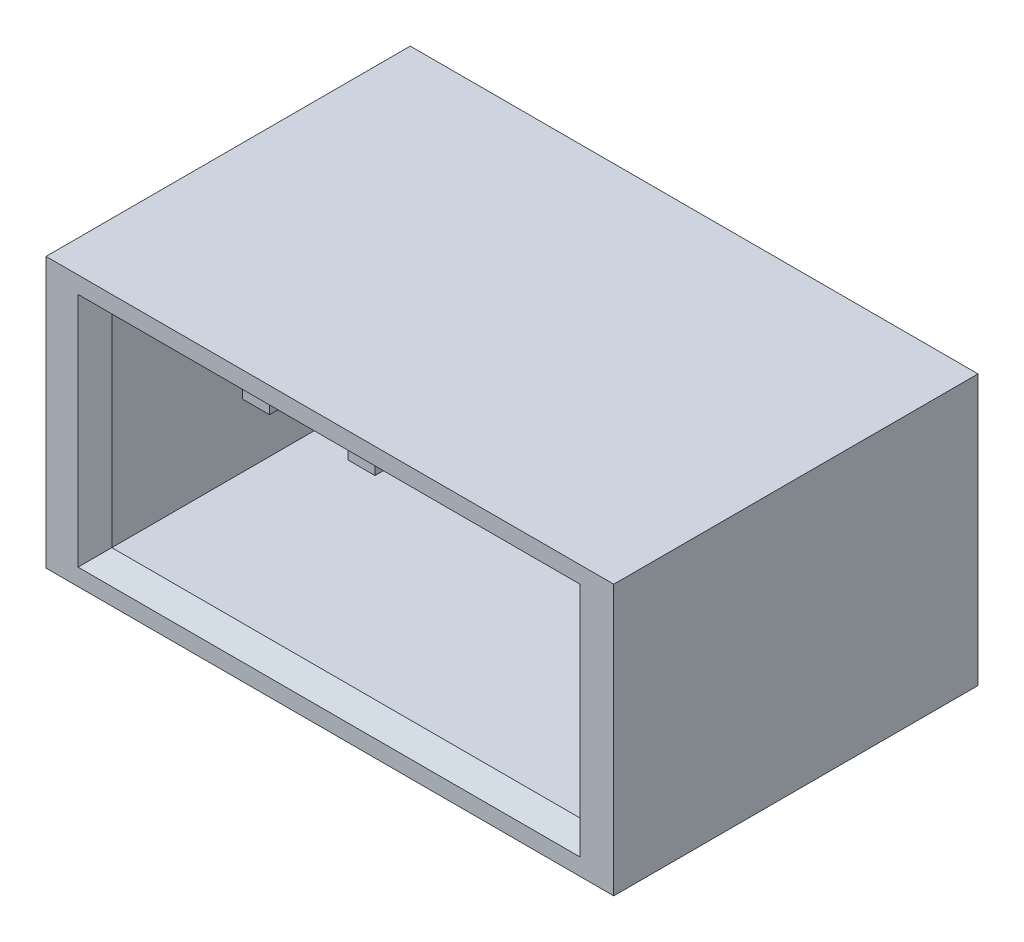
ISO-10303-21;
HEADER;
FILE_DESCRIPTION(('STEP AP214'),'2;1');
FILE_NAME('part.step','',(''),(''),'','','');
FILE_SCHEMA(('AUTOMOTIVE_DESIGN { 1 0 10303 214 1 1 1 1 }'));
ENDSEC;
DATA;
#1=APPLICATION_CONTEXT('core data for automotive mechanical design processes');
#2=APPLICATION_PROTOCOL_DEFINITION('international standard','automotive_design',2000,#1);
#3=PRODUCT_CONTEXT('',#1,'mechanical');
#4=PRODUCT('Part','Part','',(#3));
#5=PRODUCT_RELATED_PRODUCT_CATEGORY('part','',(#4));
#6=PRODUCT_DEFINITION_FORMATION('','',#4);
#7=PRODUCT_DEFINITION_CONTEXT('part definition',#1,'design');
#8=PRODUCT_DEFINITION('design','',#6,#7);
#9=PRODUCT_DEFINITION_SHAPE('','',#8);
#10=(LENGTH_UNIT() NAMED_UNIT(*) SI_UNIT(.MILLI.,.METRE.));
#11=(NAMED_UNIT(*) PLANE_ANGLE_UNIT() SI_UNIT($,.RADIAN.));
#12=(NAMED_UNIT(*) SI_UNIT($,.STERADIAN.) SOLID_ANGLE_UNIT());
#13=UNCERTAINTY_MEASURE_WITH_UNIT(LENGTH_MEASURE(1.E-05),#10,'distance_accuracy_value','');
#14=(GEOMETRIC_REPRESENTATION_CONTEXT(3) GLOBAL_UNCERTAINTY_ASSIGNED_CONTEXT((#13)) GLOBAL_UNIT_ASSIGNED_CONTEXT((#10,
#11,#12)) REPRESENTATION_CONTEXT('',''));
#15=CARTESIAN_POINT('',(0.,0.,0.));
#16=DIRECTION('',(0.,0.,1.));
#17=DIRECTION('',(1.,0.,0.));
#18=AXIS2_PLACEMENT_3D('',#15,#16,#17);
#19=CARTESIAN_POINT('',(-1.14000000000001,0.,3.16799999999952));
#20=DIRECTION('',(0.948683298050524,0.,0.316227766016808));
#21=DIRECTION('',(0.316227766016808,0.,-0.948683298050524));
#22=AXIS2_PLACEMENT_3D('',#19,#20,#21);
#23=PLANE('',#22);
#24=DIRECTION('',(-0.301511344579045,0.301511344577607,0.904534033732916));
#25=VECTOR('',#24,1.);
#26=CARTESIAN_POINT('',(-1.08999999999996,-0.174999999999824,3.01800000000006));
#27=LINE('',#26,#25);
#28=CARTESIAN_POINT('',(-1.09000000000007,-0.174999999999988,3.01800000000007));
#29=VERTEX_POINT('',#28);
#30=CARTESIAN_POINT('',(-1.19000000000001,-0.0750000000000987,3.31799999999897));
#31=VERTEX_POINT('',#30);
#32=EDGE_CURVE('E336',#29,#31,#27,.T.);
#33=ORIENTED_EDGE('',*,*,#32,.F.);
#34=DIRECTION('',(0.,1.,0.));
#35=VECTOR('',#34,1.);
#36=CARTESIAN_POINT('',(-1.08999999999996,-0.175000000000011,3.01800000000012));
#37=LINE('',#36,#35);
#38=CARTESIAN_POINT('',(-1.09000000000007,0.174999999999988,3.01800000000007));
#39=VERTEX_POINT('',#38);
#40=EDGE_CURVE('E345',#39,#29,#37,.F.);
#41=ORIENTED_EDGE('',*,*,#40,.F.);
#42=DIRECTION('',(0.301511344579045,0.301511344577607,-0.904534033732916));
#43=VECTOR('',#42,1.);
#44=CARTESIAN_POINT('',(-1.19000000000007,0.0750000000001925,3.31799999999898));
#45=LINE('',#44,#43);
#46=CARTESIAN_POINT('',(-1.18999999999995,0.0750000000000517,3.31799999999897));
#47=VERTEX_POINT('',#46);
#48=EDGE_CURVE('E331',#47,#39,#45,.T.);
#49=ORIENTED_EDGE('',*,*,#48,.F.);
#50=DIRECTION('',(0.,1.,0.));
#51=VECTOR('',#50,1.);
#52=CARTESIAN_POINT('',(-1.19000000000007,0.,3.31799999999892));
#53=LINE('',#52,#51);
#54=EDGE_CURVE('E347',#31,#47,#53,.T.);
#55=ORIENTED_EDGE('',*,*,#54,.F.);
#56=EDGE_LOOP('',(#33,#41,#49,#55));
#57=FACE_BOUND('',#56,.T.);
#58=ADVANCED_FACE('F16',(#57),#23,.T.);
#59=CARTESIAN_POINT('',(0.109999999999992,0.,3.16799999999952));
#60=DIRECTION('',(0.948683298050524,0.,0.316227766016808));
#61=DIRECTION('',(0.316227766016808,0.,-0.948683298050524));
#62=AXIS2_PLACEMENT_3D('',#59,#60,#61);
#63=PLANE('',#62);
#64=DIRECTION('',(-0.301511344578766,0.301511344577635,0.904534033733));
#65=VECTOR('',#64,1.);
#66=CARTESIAN_POINT('',(0.159999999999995,-0.174999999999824,3.01800000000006));
#67=LINE('',#66,#65);
#68=CARTESIAN_POINT('',(0.159999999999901,-0.174999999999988,3.01800000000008));
#69=VERTEX_POINT('',#68);
#70=CARTESIAN_POINT('',(0.0600000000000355,-0.0750000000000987,3.31799999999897));
#71=VERTEX_POINT('',#70);
#72=EDGE_CURVE('E399',#69,#71,#67,.T.);
#73=ORIENTED_EDGE('',*,*,#72,.F.);
#74=DIRECTION('',(0.,1.,0.));
#75=VECTOR('',#74,1.);
#76=CARTESIAN_POINT('',(0.159999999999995,-0.175000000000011,3.01800000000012));
#77=LINE('',#76,#75);
#78=CARTESIAN_POINT('',(0.159999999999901,0.174999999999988,3.01800000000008));
#79=VERTEX_POINT('',#78);
#80=EDGE_CURVE('E401',#79,#69,#77,.F.);
#81=ORIENTED_EDGE('',*,*,#80,.F.);
#82=DIRECTION('',(0.301511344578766,0.301511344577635,-0.904534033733));
#83=VECTOR('',#82,1.);
#84=CARTESIAN_POINT('',(0.0599999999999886,0.0750000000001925,3.31799999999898));
#85=LINE('',#84,#83);
#86=CARTESIAN_POINT('',(0.0600000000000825,0.0750000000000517,3.31799999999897));
#87=VERTEX_POINT('',#86);
#88=EDGE_CURVE('E390',#87,#79,#85,.T.);
#89=ORIENTED_EDGE('',*,*,#88,.F.);
#90=DIRECTION('',(0.,1.,0.));
#91=VECTOR('',#90,1.);
#92=CARTESIAN_POINT('',(0.0599999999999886,0.,3.31799999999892));
#93=LINE('',#92,#91);
#94=EDGE_CURVE('E393',#71,#87,#93,.T.);
#95=ORIENTED_EDGE('',*,*,#94,.F.);
#96=EDGE_LOOP('',(#73,#81,#89,#95));
#97=FACE_BOUND('',#96,.T.);
#98=ADVANCED_FACE('F545',(#97),#63,.T.);
#99=CARTESIAN_POINT('',(-1.08999999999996,-0.175000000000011,-0.899999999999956));
#100=DIRECTION('',(1.,0.,0.));
#101=DIRECTION('',(0.,0.,-1.));
#102=AXIS2_PLACEMENT_3D('',#99,#100,#101);
#103=PLANE('',#102);
#104=DIRECTION('',(0.,0.,1.));
#105=VECTOR('',#104,1.);
#106=CARTESIAN_POINT('',(-1.08999999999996,0.175000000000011,-0.899999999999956));
#107=LINE('',#106,#105);
#108=CARTESIAN_POINT('',(-1.08999999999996,0.175000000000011,0.81800000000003));
#109=VERTEX_POINT('',#108);
#110=EDGE_CURVE('E363',#39,#109,#107,.F.);
#111=ORIENTED_EDGE('',*,*,#110,.F.);
#112=ORIENTED_EDGE('',*,*,#40,.T.);
#113=DIRECTION('',(0.,0.,-1.));
#114=VECTOR('',#113,1.);
#115=CARTESIAN_POINT('',(-1.08999999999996,-0.175000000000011,-0.899999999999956));
#116=LINE('',#115,#114);
#117=CARTESIAN_POINT('',(-1.08999999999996,-0.175000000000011,0.81800000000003));
#118=VERTEX_POINT('',#117);
#119=EDGE_CURVE('E364',#118,#29,#116,.F.);
#120=ORIENTED_EDGE('',*,*,#119,.F.);
#121=DIRECTION('',(0.,1.,0.));
#122=VECTOR('',#121,1.);
#123=CARTESIAN_POINT('',(-1.08999999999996,-0.175000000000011,0.81800000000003));
#124=LINE('',#123,#122);
#125=EDGE_CURVE('E19',#118,#109,#124,.T.);
#126=ORIENTED_EDGE('',*,*,#125,.T.);
#127=EDGE_LOOP('',(#111,#112,#120,#126));
#128=FACE_BOUND('',#127,.T.);
#129=ADVANCED_FACE('F361',(#128),#103,.T.);
#130=CARTESIAN_POINT('',(-1.25000000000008,-0.125000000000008,3.16799999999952));
#131=DIRECTION('',(0.,-0.948683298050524,0.316227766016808));
#132=DIRECTION('',(0.,-0.316227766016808,-0.948683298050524));
#133=AXIS2_PLACEMENT_3D('',#130,#131,#132);
#134=PLANE('',#133);
#135=DIRECTION('',(0.301511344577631,0.301511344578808,0.904534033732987));
#136=VECTOR('',#135,1.);
#137=CARTESIAN_POINT('',(-1.40999999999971,-0.175000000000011,3.01800000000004));
#138=LINE('',#137,#136);
#139=CARTESIAN_POINT('',(-1.40999999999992,-0.174999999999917,3.01800000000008));
#140=VERTEX_POINT('',#139);
#141=CARTESIAN_POINT('',(-1.31000000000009,-0.0750000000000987,3.31799999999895));
#142=VERTEX_POINT('',#141);
#143=EDGE_CURVE('E418',#140,#142,#138,.T.);
#144=ORIENTED_EDGE('',*,*,#143,.F.);
#145=DIRECTION('',(1.,0.,0.));
#146=VECTOR('',#145,1.);
#147=CARTESIAN_POINT('',(-1.40999999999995,-0.175000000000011,3.01800000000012));
#148=LINE('',#147,#146);
#149=EDGE_CURVE('E342',#29,#140,#148,.F.);
#150=ORIENTED_EDGE('',*,*,#149,.F.);
#151=ORIENTED_EDGE('',*,*,#32,.T.);
#152=DIRECTION('',(1.,0.,0.));
#153=VECTOR('',#152,1.);
#154=CARTESIAN_POINT('',(0.,-0.0750000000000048,3.31799999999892));
#155=LINE('',#154,#153);
#156=EDGE_CURVE('E339',#142,#31,#155,.T.);
#157=ORIENTED_EDGE('',*,*,#156,.F.);
#158=EDGE_LOOP('',(#144,#150,#151,#157));
#159=FACE_BOUND('',#158,.T.);
#160=ADVANCED_FACE('F337',(#159),#134,.T.);
#161=CARTESIAN_POINT('',(0.,0.,3.31799999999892));
#162=DIRECTION('',(0.,0.,1.));
#163=DIRECTION('',(1.,0.,0.));
#164=AXIS2_PLACEMENT_3D('',#161,#162,#163);
#165=PLANE('',#164);
#166=ORIENTED_EDGE('',*,*,#54,.T.);
#167=DIRECTION('',(1.,0.,0.));
#168=VECTOR('',#167,1.);
#169=CARTESIAN_POINT('',(-1.25000000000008,0.0750000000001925,3.31799999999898));
#170=LINE('',#169,#168);
#171=CARTESIAN_POINT('',(-1.31000000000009,0.0750000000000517,3.31799999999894));
#172=VERTEX_POINT('',#171);
#173=EDGE_CURVE('E406',#172,#47,#170,.T.);
#174=ORIENTED_EDGE('',*,*,#173,.F.);
#175=DIRECTION('',(0.,1.,0.));
#176=VECTOR('',#175,1.);
#177=CARTESIAN_POINT('',(-1.3100000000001,0.,3.31799999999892));
#178=LINE('',#177,#176);
#179=EDGE_CURVE('E353',#142,#172,#178,.T.);
#180=ORIENTED_EDGE('',*,*,#179,.F.);
#181=ORIENTED_EDGE('',*,*,#156,.T.);
#182=EDGE_LOOP('',(#166,#174,#180,#181));
#183=FACE_BOUND('',#182,.T.);
#184=ADVANCED_FACE('F351',(#183),#165,.T.);
#185=CARTESIAN_POINT('',(-1.25000000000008,0.125000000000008,3.16799999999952));
#186=DIRECTION('',(0.,0.948683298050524,0.316227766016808));
#187=DIRECTION('',(0.,-0.316227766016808,0.948683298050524));
#188=AXIS2_PLACEMENT_3D('',#185,#186,#187);
#189=PLANE('',#188);
#190=DIRECTION('',(-0.301511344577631,0.301511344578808,-0.904534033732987));
#191=VECTOR('',#190,1.);
#192=CARTESIAN_POINT('',(-1.3100000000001,0.0750000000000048,3.31799999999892));
#193=LINE('',#192,#191);
#194=CARTESIAN_POINT('',(-1.40999999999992,0.174999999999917,3.01800000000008));
#195=VERTEX_POINT('',#194);
#196=EDGE_CURVE('E411',#172,#195,#193,.T.);
#197=ORIENTED_EDGE('',*,*,#196,.F.);
#198=ORIENTED_EDGE('',*,*,#173,.T.);
#199=ORIENTED_EDGE('',*,*,#48,.T.);
#200=DIRECTION('',(1.,0.,0.));
#201=VECTOR('',#200,1.);
#202=CARTESIAN_POINT('',(-1.08999999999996,0.175000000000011,3.01800000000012));
#203=LINE('',#202,#201);
#204=EDGE_CURVE('E376',#195,#39,#203,.T.);
#205=ORIENTED_EDGE('',*,*,#204,.F.);
#206=EDGE_LOOP('',(#197,#198,#199,#205));
#207=FACE_BOUND('',#206,.T.);
#208=ADVANCED_FACE('F409',(#207),#189,.T.);
#209=CARTESIAN_POINT('',(0.159999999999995,-0.175000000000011,-0.899999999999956));
#210=DIRECTION('',(1.,0.,0.));
#211=DIRECTION('',(0.,0.,-1.));
#212=AXIS2_PLACEMENT_3D('',#209,#210,#211);
#213=PLANE('',#212);
#214=DIRECTION('',(0.,0.,1.));
#215=VECTOR('',#214,1.);
#216=CARTESIAN_POINT('',(0.159999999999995,0.175000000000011,-0.899999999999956));
#217=LINE('',#216,#215);
#218=CARTESIAN_POINT('',(0.159999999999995,0.175000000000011,0.81800000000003));
#219=VERTEX_POINT('',#218);
#220=EDGE_CURVE('E415',#79,#219,#217,.F.);
#221=ORIENTED_EDGE('',*,*,#220,.F.);
#222=ORIENTED_EDGE('',*,*,#80,.T.);
#223=DIRECTION('',(0.,0.,-1.));
#224=VECTOR('',#223,1.);
#225=CARTESIAN_POINT('',(0.159999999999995,-0.175000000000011,-0.899999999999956));
#226=LINE('',#225,#224);
#227=CARTESIAN_POINT('',(0.159999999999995,-0.175000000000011,0.81800000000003));
#228=VERTEX_POINT('',#227);
#229=EDGE_CURVE('E520',#228,#69,#226,.F.);
#230=ORIENTED_EDGE('',*,*,#229,.F.);
#231=DIRECTION('',(0.,1.,0.));
#232=VECTOR('',#231,1.);
#233=CARTESIAN_POINT('',(0.159999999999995,-0.175000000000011,0.81800000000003));
#234=LINE('',#233,#232);
#235=EDGE_CURVE('E404',#228,#219,#234,.T.);
#236=ORIENTED_EDGE('',*,*,#235,.T.);
#237=EDGE_LOOP('',(#221,#222,#230,#236));
#238=FACE_BOUND('',#237,.T.);
#239=ADVANCED_FACE('F537',(#238),#213,.T.);
#240=CARTESIAN_POINT('',(0.,-0.125000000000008,3.16799999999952));
#241=DIRECTION('',(0.,-0.948683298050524,0.316227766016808));
#242=DIRECTION('',(0.,-0.316227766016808,-0.948683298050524));
#243=AXIS2_PLACEMENT_3D('',#240,#241,#242);
#244=PLANE('',#243);
#245=DIRECTION('',(0.301511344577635,0.301511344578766,0.904534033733));
#246=VECTOR('',#245,1.);
#247=CARTESIAN_POINT('',(-0.159999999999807,-0.175000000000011,3.01800000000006));
#248=LINE('',#247,#246);
#249=CARTESIAN_POINT('',(-0.159999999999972,-0.174999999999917,3.01800000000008));
#250=VERTEX_POINT('',#249);
#251=CARTESIAN_POINT('',(-0.0600000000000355,-0.0750000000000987,3.31799999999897));
#252=VERTEX_POINT('',#251);
#253=EDGE_CURVE('E514',#250,#252,#248,.T.);
#254=ORIENTED_EDGE('',*,*,#253,.F.);
#255=DIRECTION('',(1.,0.,0.));
#256=VECTOR('',#255,1.);
#257=CARTESIAN_POINT('',(-0.159999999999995,-0.175000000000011,3.01800000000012));
#258=LINE('',#257,#256);
#259=EDGE_CURVE('E517',#69,#250,#258,.F.);
#260=ORIENTED_EDGE('',*,*,#259,.F.);
#261=ORIENTED_EDGE('',*,*,#72,.T.);
#262=DIRECTION('',(1.,0.,0.));
#263=VECTOR('',#262,1.);
#264=CARTESIAN_POINT('',(0.,-0.0750000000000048,3.31799999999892));
#265=LINE('',#264,#263);
#266=EDGE_CURVE('E396',#252,#71,#265,.T.);
#267=ORIENTED_EDGE('',*,*,#266,.F.);
#268=EDGE_LOOP('',(#254,#260,#261,#267));
#269=FACE_BOUND('',#268,.T.);
#270=ADVANCED_FACE('F550',(#269),#244,.T.);
#271=CARTESIAN_POINT('',(0.,0.,3.31799999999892));
#272=DIRECTION('',(0.,0.,1.));
#273=DIRECTION('',(1.,0.,0.));
#274=AXIS2_PLACEMENT_3D('',#271,#272,#273);
#275=PLANE('',#274);
#276=ORIENTED_EDGE('',*,*,#94,.T.);
#277=DIRECTION('',(1.,0.,0.));
#278=VECTOR('',#277,1.);
#279=CARTESIAN_POINT('',(0.,0.0750000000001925,3.31799999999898));
#280=LINE('',#279,#278);
#281=CARTESIAN_POINT('',(-0.0600000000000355,0.0750000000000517,3.31799999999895));
#282=VERTEX_POINT('',#281);
#283=EDGE_CURVE('E387',#282,#87,#280,.T.);
#284=ORIENTED_EDGE('',*,*,#283,.F.);
#285=DIRECTION('',(0.,1.,0.));
#286=VECTOR('',#285,1.);
#287=CARTESIAN_POINT('',(-0.0600000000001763,0.,3.31799999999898));
#288=LINE('',#287,#286);
#289=EDGE_CURVE('E511',#252,#282,#288,.T.);
#290=ORIENTED_EDGE('',*,*,#289,.F.);
#291=ORIENTED_EDGE('',*,*,#266,.T.);
#292=EDGE_LOOP('',(#276,#284,#290,#291));
#293=FACE_BOUND('',#292,.T.);
#294=ADVANCED_FACE('F547',(#293),#275,.T.);
#295=CARTESIAN_POINT('',(0.,0.125000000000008,3.16799999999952));
#296=DIRECTION('',(0.,0.948683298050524,0.316227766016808));
#297=DIRECTION('',(0.,-0.316227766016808,0.948683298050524));
#298=AXIS2_PLACEMENT_3D('',#295,#296,#297);
#299=PLANE('',#298);
#300=DIRECTION('',(-0.301511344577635,0.301511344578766,-0.904534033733));
#301=VECTOR('',#300,1.);
#302=CARTESIAN_POINT('',(-0.0600000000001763,0.0750000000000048,3.31799999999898));
#303=LINE('',#302,#301);
#304=CARTESIAN_POINT('',(-0.159999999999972,0.174999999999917,3.01800000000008));
#305=VERTEX_POINT('',#304);
#306=EDGE_CURVE('E508',#282,#305,#303,.T.);
#307=ORIENTED_EDGE('',*,*,#306,.F.);
#308=ORIENTED_EDGE('',*,*,#283,.T.);
#309=ORIENTED_EDGE('',*,*,#88,.T.);
#310=DIRECTION('',(1.,0.,0.));
#311=VECTOR('',#310,1.);
#312=CARTESIAN_POINT('',(0.159999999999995,0.175000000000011,3.01800000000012));
#313=LINE('',#312,#311);
#314=EDGE_CURVE('E526',#305,#79,#313,.T.);
#315=ORIENTED_EDGE('',*,*,#314,.F.);
#316=EDGE_LOOP('',(#307,#308,#309,#315));
#317=FACE_BOUND('',#316,.T.);
#318=ADVANCED_FACE('F542',(#317),#299,.T.);
#319=CARTESIAN_POINT('',(-3.59000000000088,-0.175000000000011,-0.899999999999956));
#320=DIRECTION('',(1.,0.,0.));
#321=DIRECTION('',(0.,0.,-1.));
#322=AXIS2_PLACEMENT_3D('',#319,#320,#321);
#323=PLANE('',#322);
#324=DIRECTION('',(0.,0.,-1.));
#325=VECTOR('',#324,1.);
#326=CARTESIAN_POINT('',(-3.59000000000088,-0.175000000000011,-0.899999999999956));
#327=LINE('',#326,#325);
#328=CARTESIAN_POINT('',(-3.59000000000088,-0.175000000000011,0.81800000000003));
#329=VERTEX_POINT('',#328);
#330=CARTESIAN_POINT('',(-3.59000000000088,-0.175000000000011,3.31799999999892));
#331=VERTEX_POINT('',#330);
#332=EDGE_CURVE('E506',#329,#331,#327,.F.);
#333=ORIENTED_EDGE('',*,*,#332,.F.);
#334=DIRECTION('',(0.,1.,0.));
#335=VECTOR('',#334,1.);
#336=CARTESIAN_POINT('',(-3.59000000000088,-0.175000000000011,0.81800000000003));
#337=LINE('',#336,#335);
#338=CARTESIAN_POINT('',(-3.59000000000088,0.175000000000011,0.81800000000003));
#339=VERTEX_POINT('',#338);
#340=EDGE_CURVE('E382',#329,#339,#337,.T.);
#341=ORIENTED_EDGE('',*,*,#340,.T.);
#342=DIRECTION('',(0.,0.,1.));
#343=VECTOR('',#342,1.);
#344=CARTESIAN_POINT('',(-3.59000000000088,0.175000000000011,-0.899999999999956));
#345=LINE('',#344,#343);
#346=CARTESIAN_POINT('',(-3.59000000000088,0.175000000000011,3.31799999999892));
#347=VERTEX_POINT('',#346);
#348=EDGE_CURVE('E492',#347,#339,#345,.F.);
#349=ORIENTED_EDGE('',*,*,#348,.F.);
#350=DIRECTION('',(0.,1.,0.));
#351=VECTOR('',#350,1.);
#352=CARTESIAN_POINT('',(-3.59000000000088,0.,3.31799999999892));
#353=LINE('',#352,#351);
#354=EDGE_CURVE('E498',#331,#347,#353,.T.);
#355=ORIENTED_EDGE('',*,*,#354,.F.);
#356=EDGE_LOOP('',(#333,#341,#349,#355));
#357=FACE_BOUND('',#356,.T.);
#358=ADVANCED_FACE('F789',(#357),#323,.T.);
#359=CARTESIAN_POINT('',(-2.34000000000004,-0.175000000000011,-0.899999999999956));
#360=DIRECTION('',(1.,0.,0.));
#361=DIRECTION('',(0.,0.,-1.));
#362=AXIS2_PLACEMENT_3D('',#359,#360,#361);
#363=PLANE('',#362);
#364=DIRECTION('',(0.,0.,-1.));
#365=VECTOR('',#364,1.);
#366=CARTESIAN_POINT('',(-2.34000000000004,-0.175000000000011,-0.899999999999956));
#367=LINE('',#366,#365);
#368=CARTESIAN_POINT('',(-2.34000000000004,-0.175000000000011,0.81800000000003));
#369=VERTEX_POINT('',#368);
#370=CARTESIAN_POINT('',(-2.34000000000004,-0.175000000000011,3.31799999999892));
#371=VERTEX_POINT('',#370);
#372=EDGE_CURVE('E488',#369,#371,#367,.F.);
#373=ORIENTED_EDGE('',*,*,#372,.F.);
#374=DIRECTION('',(0.,1.,0.));
#375=VECTOR('',#374,1.);
#376=CARTESIAN_POINT('',(-2.34000000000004,-0.175000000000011,0.81800000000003));
#377=LINE('',#376,#375);
#378=CARTESIAN_POINT('',(-2.34000000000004,0.175000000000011,0.81800000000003));
#379=VERTEX_POINT('',#378);
#380=EDGE_CURVE('E380',#369,#379,#377,.T.);
#381=ORIENTED_EDGE('',*,*,#380,.T.);
#382=DIRECTION('',(0.,0.,1.));
#383=VECTOR('',#382,1.);
#384=CARTESIAN_POINT('',(-2.34000000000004,0.175000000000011,-0.899999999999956));
#385=LINE('',#384,#383);
#386=CARTESIAN_POINT('',(-2.34000000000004,0.175000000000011,3.31799999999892));
#387=VERTEX_POINT('',#386);
#388=EDGE_CURVE('E474',#387,#379,#385,.F.);
#389=ORIENTED_EDGE('',*,*,#388,.F.);
#390=DIRECTION('',(0.,1.,0.));
#391=VECTOR('',#390,1.);
#392=CARTESIAN_POINT('',(-2.34000000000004,0.,3.31799999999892));
#393=LINE('',#392,#391);
#394=EDGE_CURVE('E480',#371,#387,#393,.T.);
#395=ORIENTED_EDGE('',*,*,#394,.F.);
#396=EDGE_LOOP('',(#373,#381,#389,#395));
#397=FACE_BOUND('',#396,.T.);
#398=ADVANCED_FACE('F1122',(#397),#363,.T.);
#399=CARTESIAN_POINT('',(-1.08999999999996,0.175000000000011,-0.899999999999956));
#400=DIRECTION('',(0.,1.,0.));
#401=DIRECTION('',(0.,0.,1.));
#402=AXIS2_PLACEMENT_3D('',#399,#400,#401);
#403=PLANE('',#402);
#404=DIRECTION('',(0.,0.,1.));
#405=VECTOR('',#404,1.);
#406=CARTESIAN_POINT('',(-1.40999999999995,0.175000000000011,-0.899999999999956));
#407=LINE('',#406,#405);
#408=CARTESIAN_POINT('',(-1.40999999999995,0.175000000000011,0.81800000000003));
#409=VERTEX_POINT('',#408);
#410=EDGE_CURVE('E433',#195,#409,#407,.F.);
#411=ORIENTED_EDGE('',*,*,#410,.F.);
#412=ORIENTED_EDGE('',*,*,#204,.T.);
#413=ORIENTED_EDGE('',*,*,#110,.T.);
#414=DIRECTION('',(1.,0.,0.));
#415=VECTOR('',#414,1.);
#416=CARTESIAN_POINT('',(-1.08999999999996,0.175000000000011,0.81800000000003));
#417=LINE('',#416,#415);
#418=EDGE_CURVE('E368',#109,#409,#417,.F.);
#419=ORIENTED_EDGE('',*,*,#418,.T.);
#420=EDGE_LOOP('',(#411,#412,#413,#419));
#421=FACE_BOUND('',#420,.T.);
#422=ADVANCED_FACE('F379',(#421),#403,.T.);
#423=CARTESIAN_POINT('',(-1.40999999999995,-0.175000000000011,-0.899999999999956));
#424=DIRECTION('',(0.,-1.,0.));
#425=DIRECTION('',(0.,0.,-1.));
#426=AXIS2_PLACEMENT_3D('',#423,#424,#425);
#427=PLANE('',#426);
#428=ORIENTED_EDGE('',*,*,#119,.T.);
#429=ORIENTED_EDGE('',*,*,#149,.T.);
#430=DIRECTION('',(0.,0.,1.));
#431=VECTOR('',#430,1.);
#432=CARTESIAN_POINT('',(-1.40999999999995,-0.175000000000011,-0.899999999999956));
#433=LINE('',#432,#431);
#434=CARTESIAN_POINT('',(-1.40999999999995,-0.175000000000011,0.81800000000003));
#435=VERTEX_POINT('',#434);
#436=EDGE_CURVE('E430',#435,#140,#433,.T.);
#437=ORIENTED_EDGE('',*,*,#436,.F.);
#438=DIRECTION('',(1.,0.,0.));
#439=VECTOR('',#438,1.);
#440=CARTESIAN_POINT('',(-1.40999999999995,-0.175000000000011,0.81800000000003));
#441=LINE('',#440,#439);
#442=EDGE_CURVE('E425',#435,#118,#441,.T.);
#443=ORIENTED_EDGE('',*,*,#442,.T.);
#444=EDGE_LOOP('',(#428,#429,#437,#443));
#445=FACE_BOUND('',#444,.T.);
#446=ADVANCED_FACE('F428',(#445),#427,.T.);
#447=CARTESIAN_POINT('',(-1.35999999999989,0.,3.16799999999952));
#448=DIRECTION('',(-0.948683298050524,0.,0.316227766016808));
#449=DIRECTION('',(0.316227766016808,0.,0.948683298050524));
#450=AXIS2_PLACEMENT_3D('',#447,#448,#449);
#451=PLANE('',#450);
#452=ORIENTED_EDGE('',*,*,#196,.T.);
#453=DIRECTION('',(0.,1.,0.));
#454=VECTOR('',#453,1.);
#455=CARTESIAN_POINT('',(-1.40999999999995,0.175000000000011,3.01800000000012));
#456=LINE('',#455,#454);
#457=EDGE_CURVE('E432',#140,#195,#456,.T.);
#458=ORIENTED_EDGE('',*,*,#457,.F.);
#459=ORIENTED_EDGE('',*,*,#143,.T.);
#460=ORIENTED_EDGE('',*,*,#179,.T.);
#461=EDGE_LOOP('',(#452,#458,#459,#460));
#462=FACE_BOUND('',#461,.T.);
#463=ADVANCED_FACE('F417',(#462),#451,.T.);
#464=CARTESIAN_POINT('',(0.159999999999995,0.175000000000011,-0.899999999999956));
#465=DIRECTION('',(0.,1.,0.));
#466=DIRECTION('',(0.,0.,1.));
#467=AXIS2_PLACEMENT_3D('',#464,#465,#466);
#468=PLANE('',#467);
#469=DIRECTION('',(0.,0.,1.));
#470=VECTOR('',#469,1.);
#471=CARTESIAN_POINT('',(-0.159999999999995,0.175000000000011,-0.899999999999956));
#472=LINE('',#471,#470);
#473=CARTESIAN_POINT('',(-0.159999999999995,0.175000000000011,0.81800000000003));
#474=VERTEX_POINT('',#473);
#475=EDGE_CURVE('E467',#305,#474,#472,.F.);
#476=ORIENTED_EDGE('',*,*,#475,.F.);
#477=ORIENTED_EDGE('',*,*,#314,.T.);
#478=ORIENTED_EDGE('',*,*,#220,.T.);
#479=DIRECTION('',(1.,0.,0.));
#480=VECTOR('',#479,1.);
#481=CARTESIAN_POINT('',(0.159999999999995,0.175000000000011,0.81800000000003));
#482=LINE('',#481,#480);
#483=EDGE_CURVE('E529',#219,#474,#482,.F.);
#484=ORIENTED_EDGE('',*,*,#483,.T.);
#485=EDGE_LOOP('',(#476,#477,#478,#484));
#486=FACE_BOUND('',#485,.T.);
#487=ADVANCED_FACE('F534',(#486),#468,.T.);
#488=CARTESIAN_POINT('',(-0.159999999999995,-0.175000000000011,-0.899999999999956));
#489=DIRECTION('',(0.,-1.,0.));
#490=DIRECTION('',(0.,0.,-1.));
#491=AXIS2_PLACEMENT_3D('',#488,#489,#490);
#492=PLANE('',#491);
#493=ORIENTED_EDGE('',*,*,#229,.T.);
#494=ORIENTED_EDGE('',*,*,#259,.T.);
#495=DIRECTION('',(0.,0.,1.));
#496=VECTOR('',#495,1.);
#497=CARTESIAN_POINT('',(-0.159999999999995,-0.175000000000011,-0.899999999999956));
#498=LINE('',#497,#496);
#499=CARTESIAN_POINT('',(-0.159999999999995,-0.175000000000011,0.81800000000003));
#500=VERTEX_POINT('',#499);
#501=EDGE_CURVE('E464',#500,#250,#498,.T.);
#502=ORIENTED_EDGE('',*,*,#501,.F.);
#503=DIRECTION('',(1.,0.,0.));
#504=VECTOR('',#503,1.);
#505=CARTESIAN_POINT('',(-0.159999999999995,-0.175000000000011,0.81800000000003));
#506=LINE('',#505,#504);
#507=EDGE_CURVE('E523',#500,#228,#506,.T.);
#508=ORIENTED_EDGE('',*,*,#507,.T.);
#509=EDGE_LOOP('',(#493,#494,#502,#508));
#510=FACE_BOUND('',#509,.T.);
#511=ADVANCED_FACE('F554',(#510),#492,.T.);
#512=CARTESIAN_POINT('',(-0.109999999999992,0.,3.16799999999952));
#513=DIRECTION('',(-0.948683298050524,0.,0.316227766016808));
#514=DIRECTION('',(0.316227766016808,0.,0.948683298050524));
#515=AXIS2_PLACEMENT_3D('',#512,#513,#514);
#516=PLANE('',#515);
#517=ORIENTED_EDGE('',*,*,#306,.T.);
#518=DIRECTION('',(0.,1.,0.));
#519=VECTOR('',#518,1.);
#520=CARTESIAN_POINT('',(-0.159999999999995,0.175000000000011,3.01800000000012));
#521=LINE('',#520,#519);
#522=EDGE_CURVE('E461',#250,#305,#521,.T.);
#523=ORIENTED_EDGE('',*,*,#522,.F.);
#524=ORIENTED_EDGE('',*,*,#253,.T.);
#525=ORIENTED_EDGE('',*,*,#289,.T.);
#526=EDGE_LOOP('',(#517,#523,#524,#525));
#527=FACE_BOUND('',#526,.T.);
#528=ADVANCED_FACE('F560',(#527),#516,.T.);
#529=CARTESIAN_POINT('',(-3.9099999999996,-0.175000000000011,-0.899999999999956));
#530=DIRECTION('',(0.,-1.,0.));
#531=DIRECTION('',(0.,0.,-1.));
#532=AXIS2_PLACEMENT_3D('',#529,#530,#531);
#533=PLANE('',#532);
#534=DIRECTION('',(0.,0.,1.));
#535=VECTOR('',#534,1.);
#536=CARTESIAN_POINT('',(-3.9099999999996,-0.175000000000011,-0.899999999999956));
#537=LINE('',#536,#535);
#538=CARTESIAN_POINT('',(-3.9099999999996,-0.175000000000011,0.81800000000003));
#539=VERTEX_POINT('',#538);
#540=CARTESIAN_POINT('',(-3.9099999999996,-0.175000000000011,3.31799999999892));
#541=VERTEX_POINT('',#540);
#542=EDGE_CURVE('E458',#539,#541,#537,.T.);
#543=ORIENTED_EDGE('',*,*,#542,.F.);
#544=DIRECTION('',(1.,0.,0.));
#545=VECTOR('',#544,1.);
#546=CARTESIAN_POINT('',(-3.9099999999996,-0.175000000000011,0.81800000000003));
#547=LINE('',#546,#545);
#548=EDGE_CURVE('E503',#539,#329,#547,.T.);
#549=ORIENTED_EDGE('',*,*,#548,.T.);
#550=ORIENTED_EDGE('',*,*,#332,.T.);
#551=DIRECTION('',(1.,0.,0.));
#552=VECTOR('',#551,1.);
#553=CARTESIAN_POINT('',(0.,-0.175000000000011,3.31799999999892));
#554=LINE('',#553,#552);
#555=EDGE_CURVE('E500',#541,#331,#554,.T.);
#556=ORIENTED_EDGE('',*,*,#555,.F.);
#557=EDGE_LOOP('',(#543,#549,#550,#556));
#558=FACE_BOUND('',#557,.T.);
#559=ADVANCED_FACE('F562',(#558),#533,.T.);
#560=CARTESIAN_POINT('',(0.,0.,3.31799999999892));
#561=DIRECTION('',(0.,0.,1.));
#562=DIRECTION('',(1.,0.,0.));
#563=AXIS2_PLACEMENT_3D('',#560,#561,#562);
#564=PLANE('',#563);
#565=DIRECTION('',(1.,0.,0.));
#566=VECTOR('',#565,1.);
#567=CARTESIAN_POINT('',(-3.59000000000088,0.175000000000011,3.31799999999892));
#568=LINE('',#567,#566);
#569=CARTESIAN_POINT('',(-3.9099999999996,0.175000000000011,3.31799999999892));
#570=VERTEX_POINT('',#569);
#571=EDGE_CURVE('E495',#570,#347,#568,.T.);
#572=ORIENTED_EDGE('',*,*,#571,.F.);
#573=DIRECTION('',(0.,1.,0.));
#574=VECTOR('',#573,1.);
#575=CARTESIAN_POINT('',(-3.9099999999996,0.175000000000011,3.31799999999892));
#576=LINE('',#575,#574);
#577=EDGE_CURVE('E455',#541,#570,#576,.T.);
#578=ORIENTED_EDGE('',*,*,#577,.F.);
#579=ORIENTED_EDGE('',*,*,#555,.T.);
#580=ORIENTED_EDGE('',*,*,#354,.T.);
#581=EDGE_LOOP('',(#572,#578,#579,#580));
#582=FACE_BOUND('',#581,.T.);
#583=ADVANCED_FACE('F569',(#582),#564,.T.);
#584=CARTESIAN_POINT('',(-3.59000000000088,0.175000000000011,-0.899999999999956));
#585=DIRECTION('',(0.,1.,0.));
#586=DIRECTION('',(0.,0.,1.));
#587=AXIS2_PLACEMENT_3D('',#584,#585,#586);
#588=PLANE('',#587);
#589=ORIENTED_EDGE('',*,*,#348,.T.);
#590=DIRECTION('',(1.,0.,0.));
#591=VECTOR('',#590,1.);
#592=CARTESIAN_POINT('',(-3.59000000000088,0.175000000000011,0.81800000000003));
#593=LINE('',#592,#591);
#594=CARTESIAN_POINT('',(-3.9099999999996,0.175000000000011,0.81800000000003));
#595=VERTEX_POINT('',#594);
#596=EDGE_CURVE('E490',#339,#595,#593,.F.);
#597=ORIENTED_EDGE('',*,*,#596,.T.);
#598=DIRECTION('',(0.,0.,1.));
#599=VECTOR('',#598,1.);
#600=CARTESIAN_POINT('',(-3.9099999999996,0.175000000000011,-0.899999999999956));
#601=LINE('',#600,#599);
#602=EDGE_CURVE('E452',#570,#595,#601,.F.);
#603=ORIENTED_EDGE('',*,*,#602,.F.);
#604=ORIENTED_EDGE('',*,*,#571,.T.);
#605=EDGE_LOOP('',(#589,#597,#603,#604));
#606=FACE_BOUND('',#605,.T.);
#607=ADVANCED_FACE('F770',(#606),#588,.T.);
#608=CARTESIAN_POINT('',(-2.65999999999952,-0.175000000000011,-0.899999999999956));
#609=DIRECTION('',(0.,-1.,0.));
#610=DIRECTION('',(0.,0.,-1.));
#611=AXIS2_PLACEMENT_3D('',#608,#609,#610);
#612=PLANE('',#611);
#613=DIRECTION('',(0.,0.,1.));
#614=VECTOR('',#613,1.);
#615=CARTESIAN_POINT('',(-2.65999999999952,-0.175000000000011,-0.899999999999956));
#616=LINE('',#615,#614);
#617=CARTESIAN_POINT('',(-2.65999999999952,-0.175000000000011,0.81800000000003));
#618=VERTEX_POINT('',#617);
#619=CARTESIAN_POINT('',(-2.65999999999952,-0.175000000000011,3.31799999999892));
#620=VERTEX_POINT('',#619);
#621=EDGE_CURVE('E449',#618,#620,#616,.T.);
#622=ORIENTED_EDGE('',*,*,#621,.F.);
#623=DIRECTION('',(1.,0.,0.));
#624=VECTOR('',#623,1.);
#625=CARTESIAN_POINT('',(-2.65999999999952,-0.175000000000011,0.81800000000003));
#626=LINE('',#625,#624);
#627=EDGE_CURVE('E485',#618,#369,#626,.T.);
#628=ORIENTED_EDGE('',*,*,#627,.T.);
#629=ORIENTED_EDGE('',*,*,#372,.T.);
#630=DIRECTION('',(1.,0.,0.));
#631=VECTOR('',#630,1.);
#632=CARTESIAN_POINT('',(0.,-0.175000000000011,3.31799999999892));
#633=LINE('',#632,#631);
#634=EDGE_CURVE('E482',#620,#371,#633,.T.);
#635=ORIENTED_EDGE('',*,*,#634,.F.);
#636=EDGE_LOOP('',(#622,#628,#629,#635));
#637=FACE_BOUND('',#636,.T.);
#638=ADVANCED_FACE('F766',(#637),#612,.T.);
#639=CARTESIAN_POINT('',(0.,0.,3.31799999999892));
#640=DIRECTION('',(0.,0.,1.));
#641=DIRECTION('',(1.,0.,0.));
#642=AXIS2_PLACEMENT_3D('',#639,#640,#641);
#643=PLANE('',#642);
#644=DIRECTION('',(1.,0.,0.));
#645=VECTOR('',#644,1.);
#646=CARTESIAN_POINT('',(-2.34000000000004,0.175000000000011,3.31799999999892));
#647=LINE('',#646,#645);
#648=CARTESIAN_POINT('',(-2.65999999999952,0.175000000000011,3.31799999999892));
#649=VERTEX_POINT('',#648);
#650=EDGE_CURVE('E477',#649,#387,#647,.T.);
#651=ORIENTED_EDGE('',*,*,#650,.F.);
#652=DIRECTION('',(0.,1.,0.));
#653=VECTOR('',#652,1.);
#654=CARTESIAN_POINT('',(-2.65999999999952,0.175000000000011,3.31799999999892));
#655=LINE('',#654,#653);
#656=EDGE_CURVE('E443',#620,#649,#655,.T.);
#657=ORIENTED_EDGE('',*,*,#656,.F.);
#658=ORIENTED_EDGE('',*,*,#634,.T.);
#659=ORIENTED_EDGE('',*,*,#394,.T.);
#660=EDGE_LOOP('',(#651,#657,#658,#659));
#661=FACE_BOUND('',#660,.T.);
#662=ADVANCED_FACE('F762',(#661),#643,.T.);
#663=CARTESIAN_POINT('',(-2.34000000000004,0.175000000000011,-0.899999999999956));
#664=DIRECTION('',(0.,1.,0.));
#665=DIRECTION('',(0.,0.,1.));
#666=AXIS2_PLACEMENT_3D('',#663,#664,#665);
#667=PLANE('',#666);
#668=ORIENTED_EDGE('',*,*,#388,.T.);
#669=DIRECTION('',(1.,0.,0.));
#670=VECTOR('',#669,1.);
#671=CARTESIAN_POINT('',(-2.34000000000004,0.175000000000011,0.81800000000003));
#672=LINE('',#671,#670);
#673=CARTESIAN_POINT('',(-2.65999999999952,0.175000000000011,0.81800000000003));
#674=VERTEX_POINT('',#673);
#675=EDGE_CURVE('E472',#379,#674,#672,.F.);
#676=ORIENTED_EDGE('',*,*,#675,.T.);
#677=DIRECTION('',(0.,0.,1.));
#678=VECTOR('',#677,1.);
#679=CARTESIAN_POINT('',(-2.65999999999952,0.175000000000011,-0.899999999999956));
#680=LINE('',#679,#678);
#681=EDGE_CURVE('E437',#649,#674,#680,.F.);
#682=ORIENTED_EDGE('',*,*,#681,.F.);
#683=ORIENTED_EDGE('',*,*,#650,.T.);
#684=EDGE_LOOP('',(#668,#676,#682,#683));
#685=FACE_BOUND('',#684,.T.);
#686=ADVANCED_FACE('F759',(#685),#667,.T.);
#687=CARTESIAN_POINT('',(-1.40999999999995,0.175000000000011,-0.899999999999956));
#688=DIRECTION('',(-1.,0.,0.));
#689=DIRECTION('',(0.,0.,1.));
#690=AXIS2_PLACEMENT_3D('',#687,#688,#689);
#691=PLANE('',#690);
#692=ORIENTED_EDGE('',*,*,#436,.T.);
#693=ORIENTED_EDGE('',*,*,#457,.T.);
#694=ORIENTED_EDGE('',*,*,#410,.T.);
#695=DIRECTION('',(0.,1.,0.));
#696=VECTOR('',#695,1.);
#697=CARTESIAN_POINT('',(-1.40999999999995,0.,0.81800000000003));
#698=LINE('',#697,#696);
#699=EDGE_CURVE('E372',#435,#409,#698,.T.);
#700=ORIENTED_EDGE('',*,*,#699,.F.);
#701=EDGE_LOOP('',(#692,#693,#694,#700));
#702=FACE_BOUND('',#701,.T.);
#703=ADVANCED_FACE('F435',(#702),#691,.T.);
#704=CARTESIAN_POINT('',(-0.159999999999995,0.175000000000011,-0.899999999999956));
#705=DIRECTION('',(-1.,0.,0.));
#706=DIRECTION('',(0.,0.,1.));
#707=AXIS2_PLACEMENT_3D('',#704,#705,#706);
#708=PLANE('',#707);
#709=ORIENTED_EDGE('',*,*,#501,.T.);
#710=ORIENTED_EDGE('',*,*,#522,.T.);
#711=ORIENTED_EDGE('',*,*,#475,.T.);
#712=DIRECTION('',(0.,1.,0.));
#713=VECTOR('',#712,1.);
#714=CARTESIAN_POINT('',(-0.159999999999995,0.,0.81800000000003));
#715=LINE('',#714,#713);
#716=EDGE_CURVE('E436',#500,#474,#715,.T.);
#717=ORIENTED_EDGE('',*,*,#716,.F.);
#718=EDGE_LOOP('',(#709,#710,#711,#717));
#719=FACE_BOUND('',#718,.T.);
#720=ADVANCED_FACE('F558',(#719),#708,.T.);
#721=CARTESIAN_POINT('',(-3.9099999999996,0.175000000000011,-0.899999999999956));
#722=DIRECTION('',(-1.,0.,0.));
#723=DIRECTION('',(0.,0.,1.));
#724=AXIS2_PLACEMENT_3D('',#721,#722,#723);
#725=PLANE('',#724);
#726=ORIENTED_EDGE('',*,*,#602,.T.);
#727=DIRECTION('',(0.,1.,0.));
#728=VECTOR('',#727,1.);
#729=CARTESIAN_POINT('',(-3.9099999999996,0.,0.81800000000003));
#730=LINE('',#729,#728);
#731=EDGE_CURVE('E440',#539,#595,#730,.T.);
#732=ORIENTED_EDGE('',*,*,#731,.F.);
#733=ORIENTED_EDGE('',*,*,#542,.T.);
#734=ORIENTED_EDGE('',*,*,#577,.T.);
#735=EDGE_LOOP('',(#726,#732,#733,#734));
#736=FACE_BOUND('',#735,.T.);
#737=ADVANCED_FACE('F750',(#736),#725,.T.);
#738=CARTESIAN_POINT('',(-2.65999999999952,0.175000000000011,-0.899999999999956));
#739=DIRECTION('',(-1.,0.,0.));
#740=DIRECTION('',(0.,0.,1.));
#741=AXIS2_PLACEMENT_3D('',#738,#739,#740);
#742=PLANE('',#741);
#743=ORIENTED_EDGE('',*,*,#681,.T.);
#744=DIRECTION('',(0.,1.,0.));
#745=VECTOR('',#744,1.);
#746=CARTESIAN_POINT('',(-2.65999999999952,0.,0.81800000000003));
#747=LINE('',#746,#745);
#748=EDGE_CURVE('E791',#618,#674,#747,.T.);
#749=ORIENTED_EDGE('',*,*,#748,.F.);
#750=ORIENTED_EDGE('',*,*,#621,.T.);
#751=ORIENTED_EDGE('',*,*,#656,.T.);
#752=EDGE_LOOP('',(#743,#749,#750,#751));
#753=FACE_BOUND('',#752,.T.);
#754=ADVANCED_FACE('F746',(#753),#742,.T.);
#755=CARTESIAN_POINT('',(0.,0.,0.81800000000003));
#756=DIRECTION('',(0.,0.,1.));
#757=DIRECTION('',(1.,0.,0.));
#758=AXIS2_PLACEMENT_3D('',#755,#756,#757);
#759=PLANE('',#758);
#760=ORIENTED_EDGE('',*,*,#627,.F.);
#761=ORIENTED_EDGE('',*,*,#748,.T.);
#762=ORIENTED_EDGE('',*,*,#675,.F.);
#763=ORIENTED_EDGE('',*,*,#380,.F.);
#764=EDGE_LOOP('',(#760,#761,#762,#763));
#765=FACE_BOUND('',#764,.T.);
#766=ORIENTED_EDGE('',*,*,#548,.F.);
#767=ORIENTED_EDGE('',*,*,#731,.T.);
#768=ORIENTED_EDGE('',*,*,#596,.F.);
#769=ORIENTED_EDGE('',*,*,#340,.F.);
#770=EDGE_LOOP('',(#766,#767,#768,#769));
#771=FACE_BOUND('',#770,.T.);
#772=ORIENTED_EDGE('',*,*,#507,.F.);
#773=ORIENTED_EDGE('',*,*,#716,.T.);
#774=ORIENTED_EDGE('',*,*,#483,.F.);
#775=ORIENTED_EDGE('',*,*,#235,.F.);
#776=EDGE_LOOP('',(#772,#773,#774,#775));
#777=FACE_BOUND('',#776,.T.);
#778=ORIENTED_EDGE('',*,*,#442,.F.);
#779=ORIENTED_EDGE('',*,*,#699,.T.);
#780=ORIENTED_EDGE('',*,*,#418,.F.);
#781=ORIENTED_EDGE('',*,*,#125,.F.);
#782=EDGE_LOOP('',(#778,#779,#780,#781));
#783=FACE_BOUND('',#782,.T.);
#784=DIRECTION('',(1.,0.,0.));
#785=VECTOR('',#784,1.);
#786=CARTESIAN_POINT('',(0.889999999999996,0.724999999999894,0.81800000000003));
#787=LINE('',#786,#785);
#788=CARTESIAN_POINT('',(0.889999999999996,0.724999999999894,0.81800000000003));
#789=VERTEX_POINT('',#788);
#790=CARTESIAN_POINT('',(-4.65999999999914,0.724999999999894,0.81800000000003));
#791=VERTEX_POINT('',#790);
#792=EDGE_CURVE('E801',#789,#791,#787,.F.);
#793=ORIENTED_EDGE('',*,*,#792,.T.);
#794=DIRECTION('',(0.,1.,0.));
#795=VECTOR('',#794,1.);
#796=CARTESIAN_POINT('',(-4.65999999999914,0.724999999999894,0.81800000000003));
#797=LINE('',#796,#795);
#798=CARTESIAN_POINT('',(-4.65999999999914,-1.6749999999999,0.81800000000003));
#799=VERTEX_POINT('',#798);
#800=EDGE_CURVE('E797',#791,#799,#797,.F.);
#801=ORIENTED_EDGE('',*,*,#800,.T.);
#802=DIRECTION('',(1.,0.,0.));
#803=VECTOR('',#802,1.);
#804=CARTESIAN_POINT('',(-4.65999999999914,-1.6749999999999,0.81800000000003));
#805=LINE('',#804,#803);
#806=CARTESIAN_POINT('',(0.889999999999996,-1.6749999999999,0.81800000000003));
#807=VERTEX_POINT('',#806);
#808=EDGE_CURVE('E793',#799,#807,#805,.T.);
#809=ORIENTED_EDGE('',*,*,#808,.T.);
#810=DIRECTION('',(0.,1.,0.));
#811=VECTOR('',#810,1.);
#812=CARTESIAN_POINT('',(0.889999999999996,-1.6749999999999,0.81800000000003));
#813=LINE('',#812,#811);
#814=EDGE_CURVE('E808',#807,#789,#813,.T.);
#815=ORIENTED_EDGE('',*,*,#814,.T.);
#816=EDGE_LOOP('',(#793,#801,#809,#815));
#817=FACE_BOUND('',#816,.T.);
#818=ADVANCED_FACE('F369',(#765,#771,#777,#783,#817),#759,.T.);
#819=CARTESIAN_POINT('',(0.,0.,-0.899999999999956));
#820=DIRECTION('',(0.,0.,1.));
#821=DIRECTION('',(1.,0.,0.));
#822=AXIS2_PLACEMENT_3D('',#819,#820,#821);
#823=PLANE('',#822);
#824=DIRECTION('',(1.,0.,0.));
#825=VECTOR('',#824,1.);
#826=CARTESIAN_POINT('',(-1.25000000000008,-0.07500000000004,-0.899999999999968));
#827=LINE('',#826,#825);
#828=CARTESIAN_POINT('',(-1.31000000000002,-0.0750000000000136,-0.899999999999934));
#829=VERTEX_POINT('',#828);
#830=CARTESIAN_POINT('',(-1.19000000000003,-0.0750000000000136,-0.899999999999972));
#831=VERTEX_POINT('',#830);
#832=EDGE_CURVE('E832',#829,#831,#827,.T.);
#833=ORIENTED_EDGE('',*,*,#832,.F.);
#834=DIRECTION('',(0.,1.,0.));
#835=VECTOR('',#834,1.);
#836=CARTESIAN_POINT('',(-1.30999999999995,0.,-0.899999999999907));
#837=LINE('',#836,#835);
#838=CARTESIAN_POINT('',(-1.31000000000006,0.0750000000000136,-0.899999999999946));
#839=VERTEX_POINT('',#838);
#840=EDGE_CURVE('E812',#839,#829,#837,.F.);
#841=ORIENTED_EDGE('',*,*,#840,.F.);
#842=DIRECTION('',(1.,0.,0.));
#843=VECTOR('',#842,1.);
#844=CARTESIAN_POINT('',(-1.25000000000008,0.07500000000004,-0.899999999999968));
#845=LINE('',#844,#843);
#846=CARTESIAN_POINT('',(-1.19000000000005,0.0750000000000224,-0.899999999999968));
#847=VERTEX_POINT('',#846);
#848=EDGE_CURVE('E814',#847,#839,#845,.F.);
#849=ORIENTED_EDGE('',*,*,#848,.F.);
#850=DIRECTION('',(0.,1.,0.));
#851=VECTOR('',#850,1.);
#852=CARTESIAN_POINT('',(-1.18999999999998,0.,-0.899999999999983));
#853=LINE('',#852,#851);
#854=EDGE_CURVE('E823',#831,#847,#853,.T.);
#855=ORIENTED_EDGE('',*,*,#854,.F.);
#856=EDGE_LOOP('',(#833,#841,#849,#855));
#857=FACE_BOUND('',#856,.T.);
#858=ADVANCED_FACE('F739',(#857),#823,.F.);
#859=CARTESIAN_POINT('',(0.,0.,-0.899999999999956));
#860=DIRECTION('',(0.,0.,1.));
#861=DIRECTION('',(1.,0.,0.));
#862=AXIS2_PLACEMENT_3D('',#859,#860,#861);
#863=PLANE('',#862);
#864=DIRECTION('',(1.,0.,0.));
#865=VECTOR('',#864,1.);
#866=CARTESIAN_POINT('',(0.,-0.07500000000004,-0.899999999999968));
#867=LINE('',#866,#865);
#868=CARTESIAN_POINT('',(-0.0600000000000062,-0.0750000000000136,-0.899999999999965));
#869=VERTEX_POINT('',#868);
#870=CARTESIAN_POINT('',(0.0600000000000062,-0.0750000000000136,-0.899999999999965));
#871=VERTEX_POINT('',#870);
#872=EDGE_CURVE('E855',#869,#871,#867,.T.);
#873=ORIENTED_EDGE('',*,*,#872,.F.);
#874=DIRECTION('',(0.,1.,0.));
#875=VECTOR('',#874,1.);
#876=CARTESIAN_POINT('',(-0.0600000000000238,0.,-0.899999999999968));
#877=LINE('',#876,#875);
#878=CARTESIAN_POINT('',(-0.0599999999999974,0.0750000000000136,-0.899999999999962));
#879=VERTEX_POINT('',#878);
#880=EDGE_CURVE('E835',#879,#869,#877,.F.);
#881=ORIENTED_EDGE('',*,*,#880,.F.);
#882=DIRECTION('',(1.,0.,0.));
#883=VECTOR('',#882,1.);
#884=CARTESIAN_POINT('',(0.,0.07500000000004,-0.899999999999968));
#885=LINE('',#884,#883);
#886=CARTESIAN_POINT('',(0.0599999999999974,0.0750000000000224,-0.899999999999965));
#887=VERTEX_POINT('',#886);
#888=EDGE_CURVE('E837',#887,#879,#885,.F.);
#889=ORIENTED_EDGE('',*,*,#888,.F.);
#890=DIRECTION('',(0.,1.,0.));
#891=VECTOR('',#890,1.);
#892=CARTESIAN_POINT('',(0.0600000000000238,0.,-0.899999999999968));
#893=LINE('',#892,#891);
#894=EDGE_CURVE('E846',#871,#887,#893,.T.);
#895=ORIENTED_EDGE('',*,*,#894,.F.);
#896=EDGE_LOOP('',(#873,#881,#889,#895));
#897=FACE_BOUND('',#896,.T.);
#898=ADVANCED_FACE('F735',(#897),#863,.F.);
#899=CARTESIAN_POINT('',(-4.65999999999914,-1.6749999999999,4.318));
#900=DIRECTION('',(0.,-1.,0.));
#901=DIRECTION('',(0.,0.,-1.));
#902=AXIS2_PLACEMENT_3D('',#899,#900,#901);
#903=PLANE('',#902);
#904=ORIENTED_EDGE('',*,*,#808,.F.);
#905=DIRECTION('',(0.,0.,1.));
#906=VECTOR('',#905,1.);
#907=CARTESIAN_POINT('',(-4.65999999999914,-1.6749999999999,4.318));
#908=LINE('',#907,#906);
#909=CARTESIAN_POINT('',(-4.65999999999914,-1.67499999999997,4.11800000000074));
#910=VERTEX_POINT('',#909);
#911=EDGE_CURVE('E799',#799,#910,#908,.T.);
#912=ORIENTED_EDGE('',*,*,#911,.T.);
#913=DIRECTION('',(1.,0.,0.));
#914=VECTOR('',#913,1.);
#915=CARTESIAN_POINT('',(-1.88500000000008,-1.67500000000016,4.11800000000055));
#916=LINE('',#915,#914);
#917=CARTESIAN_POINT('',(0.890000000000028,-1.67499999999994,4.11800000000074));
#918=VERTEX_POINT('',#917);
#919=EDGE_CURVE('E858',#918,#910,#916,.F.);
#920=ORIENTED_EDGE('',*,*,#919,.F.);
#921=DIRECTION('',(0.,0.,-1.));
#922=VECTOR('',#921,1.);
#923=CARTESIAN_POINT('',(0.889999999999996,-1.6749999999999,4.318));
#924=LINE('',#923,#922);
#925=EDGE_CURVE('E805',#918,#807,#924,.T.);
#926=ORIENTED_EDGE('',*,*,#925,.T.);
#927=EDGE_LOOP('',(#904,#912,#920,#926));
#928=FACE_BOUND('',#927,.T.);
#929=ADVANCED_FACE('F731',(#928),#903,.F.);
#930=CARTESIAN_POINT('',(-4.65999999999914,0.724999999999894,4.318));
#931=DIRECTION('',(-1.,0.,0.));
#932=DIRECTION('',(0.,0.,1.));
#933=AXIS2_PLACEMENT_3D('',#930,#931,#932);
#934=PLANE('',#933);
#935=ORIENTED_EDGE('',*,*,#800,.F.);
#936=DIRECTION('',(0.,0.,1.));
#937=VECTOR('',#936,1.);
#938=CARTESIAN_POINT('',(-4.65999999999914,0.724999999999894,4.318));
#939=LINE('',#938,#937);
#940=CARTESIAN_POINT('',(-4.65999999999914,0.724999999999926,4.11800000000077));
#941=VERTEX_POINT('',#940);
#942=EDGE_CURVE('E803',#791,#941,#939,.T.);
#943=ORIENTED_EDGE('',*,*,#942,.T.);
#944=DIRECTION('',(0.,1.,0.));
#945=VECTOR('',#944,1.);
#946=CARTESIAN_POINT('',(-4.65999999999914,-0.474999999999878,4.1180000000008));
#947=LINE('',#946,#945);
#948=EDGE_CURVE('E864',#910,#941,#947,.T.);
#949=ORIENTED_EDGE('',*,*,#948,.F.);
#950=ORIENTED_EDGE('',*,*,#911,.F.);
#951=EDGE_LOOP('',(#935,#943,#949,#950));
#952=FACE_BOUND('',#951,.T.);
#953=ADVANCED_FACE('F727',(#952),#934,.F.);
#954=CARTESIAN_POINT('',(0.889999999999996,0.724999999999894,4.318));
#955=DIRECTION('',(0.,1.,0.));
#956=DIRECTION('',(0.,0.,1.));
#957=AXIS2_PLACEMENT_3D('',#954,#955,#956);
#958=PLANE('',#957);
#959=ORIENTED_EDGE('',*,*,#792,.F.);
#960=DIRECTION('',(0.,0.,-1.));
#961=VECTOR('',#960,1.);
#962=CARTESIAN_POINT('',(0.889999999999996,0.724999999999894,4.318));
#963=LINE('',#962,#961);
#964=CARTESIAN_POINT('',(0.890000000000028,0.724999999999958,4.1180000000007));
#965=VERTEX_POINT('',#964);
#966=EDGE_CURVE('E810',#789,#965,#963,.F.);
#967=ORIENTED_EDGE('',*,*,#966,.T.);
#968=DIRECTION('',(1.,0.,0.));
#969=VECTOR('',#968,1.);
#970=CARTESIAN_POINT('',(-1.88500000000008,0.725000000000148,4.11800000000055));
#971=LINE('',#970,#969);
#972=EDGE_CURVE('E870',#941,#965,#971,.T.);
#973=ORIENTED_EDGE('',*,*,#972,.F.);
#974=ORIENTED_EDGE('',*,*,#942,.F.);
#975=EDGE_LOOP('',(#959,#967,#973,#974));
#976=FACE_BOUND('',#975,.T.);
#977=ADVANCED_FACE('F723',(#976),#958,.F.);
#978=CARTESIAN_POINT('',(0.889999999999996,-1.6749999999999,4.318));
#979=DIRECTION('',(1.,0.,0.));
#980=DIRECTION('',(0.,0.,-1.));
#981=AXIS2_PLACEMENT_3D('',#978,#979,#980);
#982=PLANE('',#981);
#983=ORIENTED_EDGE('',*,*,#814,.F.);
#984=ORIENTED_EDGE('',*,*,#925,.F.);
#985=DIRECTION('',(0.,1.,0.));
#986=VECTOR('',#985,1.);
#987=CARTESIAN_POINT('',(0.89000000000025,-0.474999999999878,4.11800000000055));
#988=LINE('',#987,#986);
#989=EDGE_CURVE('E876',#965,#918,#988,.F.);
#990=ORIENTED_EDGE('',*,*,#989,.F.);
#991=ORIENTED_EDGE('',*,*,#966,.F.);
#992=EDGE_LOOP('',(#983,#984,#990,#991));
#993=FACE_BOUND('',#992,.T.);
#994=ADVANCED_FACE('F719',(#993),#982,.F.);
#995=CARTESIAN_POINT('',(-1.35999999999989,0.,-0.750000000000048));
#996=DIRECTION('',(-0.948683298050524,0.,-0.316227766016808));
#997=DIRECTION('',(-0.316227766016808,0.,0.948683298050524));
#998=AXIS2_PLACEMENT_3D('',#995,#996,#997);
#999=PLANE('',#998);
#1000=DIRECTION('',(0.301511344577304,0.301511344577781,-0.904534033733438));
#1001=VECTOR('',#1000,1.);
#1002=CARTESIAN_POINT('',(-1.40999999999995,-0.175000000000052,-0.5999999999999));
#1003=LINE('',#1002,#1001);
#1004=CARTESIAN_POINT('',(-1.40999999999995,-0.175000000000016,-0.599999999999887));
#1005=VERTEX_POINT('',#1004);
#1006=EDGE_CURVE('E829',#1005,#829,#1003,.T.);
#1007=ORIENTED_EDGE('',*,*,#1006,.F.);
#1008=DIRECTION('',(0.,1.,0.));
#1009=VECTOR('',#1008,1.);
#1010=CARTESIAN_POINT('',(-1.40999999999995,0.175000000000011,-0.599999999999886));
#1011=LINE('',#1010,#1009);
#1012=CARTESIAN_POINT('',(-1.40999999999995,0.175000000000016,-0.599999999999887));
#1013=VERTEX_POINT('',#1012);
#1014=EDGE_CURVE('E882',#1013,#1005,#1011,.F.);
#1015=ORIENTED_EDGE('',*,*,#1014,.F.);
#1016=DIRECTION('',(-0.301511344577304,0.301511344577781,0.904534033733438));
#1017=VECTOR('',#1016,1.);
#1018=CARTESIAN_POINT('',(-1.31000000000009,0.07500000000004,-0.899999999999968));
#1019=LINE('',#1018,#1017);
#1020=EDGE_CURVE('E817',#839,#1013,#1019,.T.);
#1021=ORIENTED_EDGE('',*,*,#1020,.F.);
#1022=ORIENTED_EDGE('',*,*,#840,.T.);
#1023=EDGE_LOOP('',(#1007,#1015,#1021,#1022));
#1024=FACE_BOUND('',#1023,.T.);
#1025=ADVANCED_FACE('F715',(#1024),#999,.T.);
#1026=CARTESIAN_POINT('',(-1.25000000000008,0.125000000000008,-0.750000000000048));
#1027=DIRECTION('',(0.,0.948683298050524,-0.316227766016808));
#1028=DIRECTION('',(0.,0.316227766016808,0.948683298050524));
#1029=AXIS2_PLACEMENT_3D('',#1026,#1027,#1028);
#1030=PLANE('',#1029);
#1031=ORIENTED_EDGE('',*,*,#1020,.T.);
#1032=DIRECTION('',(1.,0.,0.));
#1033=VECTOR('',#1032,1.);
#1034=CARTESIAN_POINT('',(-1.08999999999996,0.175000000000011,-0.599999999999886));
#1035=LINE('',#1034,#1033);
#1036=CARTESIAN_POINT('',(-1.08999999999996,0.175000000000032,-0.599999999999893));
#1037=VERTEX_POINT('',#1036);
#1038=EDGE_CURVE('E888',#1037,#1013,#1035,.F.);
#1039=ORIENTED_EDGE('',*,*,#1038,.F.);
#1040=DIRECTION('',(0.301511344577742,0.301511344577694,0.904534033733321));
#1041=VECTOR('',#1040,1.);
#1042=CARTESIAN_POINT('',(-1.18999999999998,0.0750000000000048,-0.899999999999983));
#1043=LINE('',#1042,#1041);
#1044=EDGE_CURVE('E820',#847,#1037,#1043,.T.);
#1045=ORIENTED_EDGE('',*,*,#1044,.F.);
#1046=ORIENTED_EDGE('',*,*,#848,.T.);
#1047=EDGE_LOOP('',(#1031,#1039,#1045,#1046));
#1048=FACE_BOUND('',#1047,.T.);
#1049=ADVANCED_FACE('F711',(#1048),#1030,.T.);
#1050=CARTESIAN_POINT('',(-1.14000000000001,0.,-0.750000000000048));
#1051=DIRECTION('',(0.948683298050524,0.,-0.316227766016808));
#1052=DIRECTION('',(-0.316227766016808,0.,-0.948683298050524));
#1053=AXIS2_PLACEMENT_3D('',#1050,#1051,#1052);
#1054=PLANE('',#1053);
#1055=DIRECTION('',(0.301511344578,-0.301511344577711,0.904534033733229));
#1056=VECTOR('',#1055,1.);
#1057=CARTESIAN_POINT('',(-1.19000000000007,-0.07500000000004,-0.899999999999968));
#1058=LINE('',#1057,#1056);
#1059=CARTESIAN_POINT('',(-1.08999999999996,-0.175000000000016,-0.599999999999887));
#1060=VERTEX_POINT('',#1059);
#1061=EDGE_CURVE('E826',#831,#1060,#1058,.T.);
#1062=ORIENTED_EDGE('',*,*,#1061,.F.);
#1063=ORIENTED_EDGE('',*,*,#854,.T.);
#1064=ORIENTED_EDGE('',*,*,#1044,.T.);
#1065=DIRECTION('',(0.,1.,0.));
#1066=VECTOR('',#1065,1.);
#1067=CARTESIAN_POINT('',(-1.08999999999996,-0.175000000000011,-0.599999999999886));
#1068=LINE('',#1067,#1066);
#1069=EDGE_CURVE('E894',#1060,#1037,#1068,.T.);
#1070=ORIENTED_EDGE('',*,*,#1069,.F.);
#1071=EDGE_LOOP('',(#1062,#1063,#1064,#1070));
#1072=FACE_BOUND('',#1071,.T.);
#1073=ADVANCED_FACE('F707',(#1072),#1054,.T.);
#1074=CARTESIAN_POINT('',(-1.25000000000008,-0.125000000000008,-0.750000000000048));
#1075=DIRECTION('',(0.,-0.948683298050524,-0.316227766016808));
#1076=DIRECTION('',(0.,0.316227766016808,-0.948683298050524));
#1077=AXIS2_PLACEMENT_3D('',#1074,#1075,#1076);
#1078=PLANE('',#1077);
#1079=ORIENTED_EDGE('',*,*,#1006,.T.);
#1080=ORIENTED_EDGE('',*,*,#832,.T.);
#1081=ORIENTED_EDGE('',*,*,#1061,.T.);
#1082=DIRECTION('',(1.,0.,0.));
#1083=VECTOR('',#1082,1.);
#1084=CARTESIAN_POINT('',(-1.40999999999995,-0.175000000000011,-0.599999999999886));
#1085=LINE('',#1084,#1083);
#1086=EDGE_CURVE('E903',#1005,#1060,#1085,.T.);
#1087=ORIENTED_EDGE('',*,*,#1086,.F.);
#1088=EDGE_LOOP('',(#1079,#1080,#1081,#1087));
#1089=FACE_BOUND('',#1088,.T.);
#1090=ADVANCED_FACE('F703',(#1089),#1078,.T.);
#1091=CARTESIAN_POINT('',(-0.109999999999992,0.,-0.750000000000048));
#1092=DIRECTION('',(-0.948683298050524,0.,-0.316227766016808));
#1093=DIRECTION('',(-0.316227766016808,0.,0.948683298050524));
#1094=AXIS2_PLACEMENT_3D('',#1091,#1092,#1093);
#1095=PLANE('',#1094);
#1096=DIRECTION('',(0.301511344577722,0.301511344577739,-0.904534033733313));
#1097=VECTOR('',#1096,1.);
#1098=CARTESIAN_POINT('',(-0.159999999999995,-0.175000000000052,-0.5999999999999));
#1099=LINE('',#1098,#1097);
#1100=CARTESIAN_POINT('',(-0.160000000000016,-0.175000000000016,-0.599999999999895));
#1101=VERTEX_POINT('',#1100);
#1102=EDGE_CURVE('E852',#1101,#869,#1099,.T.);
#1103=ORIENTED_EDGE('',*,*,#1102,.F.);
#1104=DIRECTION('',(0.,1.,0.));
#1105=VECTOR('',#1104,1.);
#1106=CARTESIAN_POINT('',(-0.159999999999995,0.175000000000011,-0.599999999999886));
#1107=LINE('',#1106,#1105);
#1108=CARTESIAN_POINT('',(-0.160000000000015,0.175000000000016,-0.599999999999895));
#1109=VERTEX_POINT('',#1108);
#1110=EDGE_CURVE('E906',#1109,#1101,#1107,.F.);
#1111=ORIENTED_EDGE('',*,*,#1110,.F.);
#1112=DIRECTION('',(-0.301511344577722,0.301511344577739,0.904534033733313));
#1113=VECTOR('',#1112,1.);
#1114=CARTESIAN_POINT('',(-0.0599999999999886,0.07500000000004,-0.899999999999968));
#1115=LINE('',#1114,#1113);
#1116=EDGE_CURVE('E840',#879,#1109,#1115,.T.);
#1117=ORIENTED_EDGE('',*,*,#1116,.F.);
#1118=ORIENTED_EDGE('',*,*,#880,.T.);
#1119=EDGE_LOOP('',(#1103,#1111,#1117,#1118));
#1120=FACE_BOUND('',#1119,.T.);
#1121=ADVANCED_FACE('F699',(#1120),#1095,.T.);
#1122=CARTESIAN_POINT('',(0.,0.125000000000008,-0.750000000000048));
#1123=DIRECTION('',(0.,0.948683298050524,-0.316227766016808));
#1124=DIRECTION('',(0.,0.316227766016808,0.948683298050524));
#1125=AXIS2_PLACEMENT_3D('',#1122,#1123,#1124);
#1126=PLANE('',#1125);
#1127=ORIENTED_EDGE('',*,*,#1116,.T.);
#1128=DIRECTION('',(1.,0.,0.));
#1129=VECTOR('',#1128,1.);
#1130=CARTESIAN_POINT('',(0.159999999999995,0.175000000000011,-0.599999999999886));
#1131=LINE('',#1130,#1129);
#1132=CARTESIAN_POINT('',(0.16,0.175000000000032,-0.599999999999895));
#1133=VERTEX_POINT('',#1132);
#1134=EDGE_CURVE('E912',#1133,#1109,#1131,.F.);
#1135=ORIENTED_EDGE('',*,*,#1134,.F.);
#1136=DIRECTION('',(0.301511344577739,0.301511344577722,0.904534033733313));
#1137=VECTOR('',#1136,1.);
#1138=CARTESIAN_POINT('',(0.0600000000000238,0.0750000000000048,-0.899999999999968));
#1139=LINE('',#1138,#1137);
#1140=EDGE_CURVE('E843',#887,#1133,#1139,.T.);
#1141=ORIENTED_EDGE('',*,*,#1140,.F.);
#1142=ORIENTED_EDGE('',*,*,#888,.T.);
#1143=EDGE_LOOP('',(#1127,#1135,#1141,#1142));
#1144=FACE_BOUND('',#1143,.T.);
#1145=ADVANCED_FACE('F695',(#1144),#1126,.T.);
#1146=CARTESIAN_POINT('',(0.109999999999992,0.,-0.750000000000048));
#1147=DIRECTION('',(0.948683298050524,0.,-0.316227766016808));
#1148=DIRECTION('',(-0.316227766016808,0.,-0.948683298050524));
#1149=AXIS2_PLACEMENT_3D('',#1146,#1147,#1148);
#1150=PLANE('',#1149);
#1151=DIRECTION('',(0.301511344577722,-0.301511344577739,0.904534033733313));
#1152=VECTOR('',#1151,1.);
#1153=CARTESIAN_POINT('',(0.0599999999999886,-0.07500000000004,-0.899999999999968));
#1154=LINE('',#1153,#1152);
#1155=CARTESIAN_POINT('',(0.160000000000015,-0.175000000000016,-0.599999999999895));
#1156=VERTEX_POINT('',#1155);
#1157=EDGE_CURVE('E849',#871,#1156,#1154,.T.);
#1158=ORIENTED_EDGE('',*,*,#1157,.F.);
#1159=ORIENTED_EDGE('',*,*,#894,.T.);
#1160=ORIENTED_EDGE('',*,*,#1140,.T.);
#1161=DIRECTION('',(0.,1.,0.));
#1162=VECTOR('',#1161,1.);
#1163=CARTESIAN_POINT('',(0.159999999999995,-0.175000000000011,-0.599999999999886));
#1164=LINE('',#1163,#1162);
#1165=EDGE_CURVE('E918',#1156,#1133,#1164,.T.);
#1166=ORIENTED_EDGE('',*,*,#1165,.F.);
#1167=EDGE_LOOP('',(#1158,#1159,#1160,#1166));
#1168=FACE_BOUND('',#1167,.T.);
#1169=ADVANCED_FACE('F691',(#1168),#1150,.T.);
#1170=CARTESIAN_POINT('',(0.,-0.125000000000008,-0.750000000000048));
#1171=DIRECTION('',(0.,-0.948683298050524,-0.316227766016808));
#1172=DIRECTION('',(0.,0.316227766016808,-0.948683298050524));
#1173=AXIS2_PLACEMENT_3D('',#1170,#1171,#1172);
#1174=PLANE('',#1173);
#1175=ORIENTED_EDGE('',*,*,#1102,.T.);
#1176=ORIENTED_EDGE('',*,*,#872,.T.);
#1177=ORIENTED_EDGE('',*,*,#1157,.T.);
#1178=DIRECTION('',(1.,0.,0.));
#1179=VECTOR('',#1178,1.);
#1180=CARTESIAN_POINT('',(-0.159999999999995,-0.175000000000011,-0.599999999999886));
#1181=LINE('',#1180,#1179);
#1182=EDGE_CURVE('E927',#1101,#1156,#1181,.T.);
#1183=ORIENTED_EDGE('',*,*,#1182,.F.);
#1184=EDGE_LOOP('',(#1175,#1176,#1177,#1183));
#1185=FACE_BOUND('',#1184,.T.);
#1186=ADVANCED_FACE('F687',(#1185),#1174,.T.);
#1187=CARTESIAN_POINT('',(0.,0.,-0.899999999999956));
#1188=DIRECTION('',(0.,0.,1.));
#1189=DIRECTION('',(1.,0.,0.));
#1190=AXIS2_PLACEMENT_3D('',#1187,#1188,#1189);
#1191=PLANE('',#1190);
#1192=DIRECTION('',(0.,1.,0.));
#1193=VECTOR('',#1192,1.);
#1194=CARTESIAN_POINT('',(-3.59000000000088,-0.175000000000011,-0.899999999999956));
#1195=LINE('',#1194,#1193);
#1196=CARTESIAN_POINT('',(-3.59000000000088,-0.175000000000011,-0.899999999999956));
#1197=VERTEX_POINT('',#1196);
#1198=CARTESIAN_POINT('',(-3.59000000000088,0.175000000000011,-0.899999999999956));
#1199=VERTEX_POINT('',#1198);
#1200=EDGE_CURVE('E938',#1197,#1199,#1195,.T.);
#1201=ORIENTED_EDGE('',*,*,#1200,.F.);
#1202=DIRECTION('',(1.,0.,0.));
#1203=VECTOR('',#1202,1.);
#1204=CARTESIAN_POINT('',(-3.9099999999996,-0.175000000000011,-0.899999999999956));
#1205=LINE('',#1204,#1203);
#1206=CARTESIAN_POINT('',(-3.9099999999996,-0.175000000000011,-0.899999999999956));
#1207=VERTEX_POINT('',#1206);
#1208=EDGE_CURVE('E947',#1207,#1197,#1205,.T.);
#1209=ORIENTED_EDGE('',*,*,#1208,.F.);
#1210=DIRECTION('',(0.,1.,0.));
#1211=VECTOR('',#1210,1.);
#1212=CARTESIAN_POINT('',(-3.9099999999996,0.175000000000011,-0.899999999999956));
#1213=LINE('',#1212,#1211);
#1214=CARTESIAN_POINT('',(-3.9099999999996,0.175000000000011,-0.899999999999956));
#1215=VERTEX_POINT('',#1214);
#1216=EDGE_CURVE('E930',#1215,#1207,#1213,.F.);
#1217=ORIENTED_EDGE('',*,*,#1216,.F.);
#1218=DIRECTION('',(1.,0.,0.));
#1219=VECTOR('',#1218,1.);
#1220=CARTESIAN_POINT('',(-3.59000000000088,0.175000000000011,-0.899999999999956));
#1221=LINE('',#1220,#1219);
#1222=EDGE_CURVE('E932',#1199,#1215,#1221,.F.);
#1223=ORIENTED_EDGE('',*,*,#1222,.F.);
#1224=EDGE_LOOP('',(#1201,#1209,#1217,#1223));
#1225=FACE_BOUND('',#1224,.T.);
#1226=ADVANCED_FACE('F683',(#1225),#1191,.F.);
#1227=CARTESIAN_POINT('',(0.,0.,-0.899999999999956));
#1228=DIRECTION('',(0.,0.,1.));
#1229=DIRECTION('',(1.,0.,0.));
#1230=AXIS2_PLACEMENT_3D('',#1227,#1228,#1229);
#1231=PLANE('',#1230);
#1232=DIRECTION('',(0.,1.,0.));
#1233=VECTOR('',#1232,1.);
#1234=CARTESIAN_POINT('',(-2.34000000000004,-0.175000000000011,-0.899999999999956));
#1235=LINE('',#1234,#1233);
#1236=CARTESIAN_POINT('',(-2.34000000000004,-0.175000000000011,-0.899999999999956));
#1237=VERTEX_POINT('',#1236);
#1238=CARTESIAN_POINT('',(-2.34000000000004,0.175000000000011,-0.899999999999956));
#1239=VERTEX_POINT('',#1238);
#1240=EDGE_CURVE('E961',#1237,#1239,#1235,.T.);
#1241=ORIENTED_EDGE('',*,*,#1240,.F.);
#1242=DIRECTION('',(1.,0.,0.));
#1243=VECTOR('',#1242,1.);
#1244=CARTESIAN_POINT('',(-2.65999999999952,-0.175000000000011,-0.899999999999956));
#1245=LINE('',#1244,#1243);
#1246=CARTESIAN_POINT('',(-2.65999999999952,-0.175000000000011,-0.899999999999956));
#1247=VERTEX_POINT('',#1246);
#1248=EDGE_CURVE('E970',#1247,#1237,#1245,.T.);
#1249=ORIENTED_EDGE('',*,*,#1248,.F.);
#1250=DIRECTION('',(0.,1.,0.));
#1251=VECTOR('',#1250,1.);
#1252=CARTESIAN_POINT('',(-2.65999999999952,0.175000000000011,-0.899999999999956));
#1253=LINE('',#1252,#1251);
#1254=CARTESIAN_POINT('',(-2.65999999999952,0.175000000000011,-0.899999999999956));
#1255=VERTEX_POINT('',#1254);
#1256=EDGE_CURVE('E953',#1255,#1247,#1253,.F.);
#1257=ORIENTED_EDGE('',*,*,#1256,.F.);
#1258=DIRECTION('',(1.,0.,0.));
#1259=VECTOR('',#1258,1.);
#1260=CARTESIAN_POINT('',(-2.34000000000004,0.175000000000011,-0.899999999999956));
#1261=LINE('',#1260,#1259);
#1262=EDGE_CURVE('E955',#1239,#1255,#1261,.F.);
#1263=ORIENTED_EDGE('',*,*,#1262,.F.);
#1264=EDGE_LOOP('',(#1241,#1249,#1257,#1263));
#1265=FACE_BOUND('',#1264,.T.);
#1266=ADVANCED_FACE('F679',(#1265),#1231,.F.);
#1267=CARTESIAN_POINT('',(-1.88500000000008,-1.77500000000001,4.2180000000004));
#1268=DIRECTION('',(0.,0.707106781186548,0.707106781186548));
#1269=DIRECTION('',(0.,-0.707106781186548,0.707106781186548));
#1270=AXIS2_PLACEMENT_3D('',#1267,#1268,#1269);
#1271=PLANE('',#1270);
#1272=DIRECTION('',(0.577350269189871,0.577350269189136,-0.577350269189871));
#1273=VECTOR('',#1272,1.);
#1274=CARTESIAN_POINT('',(-4.85999999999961,-1.87500000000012,4.31800000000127));
#1275=LINE('',#1274,#1273);
#1276=CARTESIAN_POINT('',(-4.86000000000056,-1.87499999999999,4.31800000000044));
#1277=VERTEX_POINT('',#1276);
#1278=EDGE_CURVE('E861',#1277,#910,#1275,.T.);
#1279=ORIENTED_EDGE('',*,*,#1278,.F.);
#1280=DIRECTION('',(1.,0.,0.));
#1281=VECTOR('',#1280,1.);
#1282=CARTESIAN_POINT('',(0.,-1.87500000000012,4.318));
#1283=LINE('',#1282,#1281);
#1284=CARTESIAN_POINT('',(1.08999999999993,-1.87499999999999,4.31800000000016));
#1285=VERTEX_POINT('',#1284);
#1286=EDGE_CURVE('E984',#1285,#1277,#1283,.F.);
#1287=ORIENTED_EDGE('',*,*,#1286,.F.);
#1288=DIRECTION('',(0.577350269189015,-0.577350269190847,0.577350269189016));
#1289=VECTOR('',#1288,1.);
#1290=CARTESIAN_POINT('',(0.89000000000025,-1.6749999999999,4.11800000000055));
#1291=LINE('',#1290,#1289);
#1292=EDGE_CURVE('E879',#918,#1285,#1291,.T.);
#1293=ORIENTED_EDGE('',*,*,#1292,.F.);
#1294=ORIENTED_EDGE('',*,*,#919,.T.);
#1295=EDGE_LOOP('',(#1279,#1287,#1293,#1294));
#1296=FACE_BOUND('',#1295,.T.);
#1297=ADVANCED_FACE('F675',(#1296),#1271,.T.);
#1298=CARTESIAN_POINT('',(-4.75999999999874,-0.474999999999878,4.2180000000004));
#1299=DIRECTION('',(0.707106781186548,0.,0.707106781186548));
#1300=DIRECTION('',(0.707106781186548,0.,-0.707106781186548));
#1301=AXIS2_PLACEMENT_3D('',#1298,#1299,#1300);
#1302=PLANE('',#1301);
#1303=ORIENTED_EDGE('',*,*,#1278,.T.);
#1304=ORIENTED_EDGE('',*,*,#948,.T.);
#1305=DIRECTION('',(0.577350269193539,-0.577350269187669,-0.57735026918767));
#1306=VECTOR('',#1305,1.);
#1307=CARTESIAN_POINT('',(-4.86000000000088,0.924999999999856,4.31800000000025));
#1308=LINE('',#1307,#1306);
#1309=CARTESIAN_POINT('',(-4.86000000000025,0.925000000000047,4.3180000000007));
#1310=VERTEX_POINT('',#1309);
#1311=EDGE_CURVE('E867',#1310,#941,#1308,.T.);
#1312=ORIENTED_EDGE('',*,*,#1311,.F.);
#1313=DIRECTION('',(0.,1.,0.));
#1314=VECTOR('',#1313,1.);
#1315=CARTESIAN_POINT('',(-4.86000000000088,0.,4.318));
#1316=LINE('',#1315,#1314);
#1317=EDGE_CURVE('E987',#1277,#1310,#1316,.T.);
#1318=ORIENTED_EDGE('',*,*,#1317,.F.);
#1319=EDGE_LOOP('',(#1303,#1304,#1312,#1318));
#1320=FACE_BOUND('',#1319,.T.);
#1321=ADVANCED_FACE('F671',(#1320),#1302,.T.);
#1322=CARTESIAN_POINT('',(-1.88500000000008,0.825000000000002,4.2180000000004));
#1323=DIRECTION('',(0.,-0.707106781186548,0.707106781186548));
#1324=DIRECTION('',(0.,-0.707106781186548,-0.707106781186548));
#1325=AXIS2_PLACEMENT_3D('',#1322,#1323,#1324);
#1326=PLANE('',#1325);
#1327=ORIENTED_EDGE('',*,*,#1311,.T.);
#1328=ORIENTED_EDGE('',*,*,#972,.T.);
#1329=DIRECTION('',(-0.577350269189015,-0.577350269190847,-0.577350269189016));
#1330=VECTOR('',#1329,1.);
#1331=CARTESIAN_POINT('',(1.08999999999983,0.92500000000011,4.31800000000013));
#1332=LINE('',#1331,#1330);
#1333=CARTESIAN_POINT('',(1.08999999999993,0.924999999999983,4.31800000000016));
#1334=VERTEX_POINT('',#1333);
#1335=EDGE_CURVE('E873',#1334,#965,#1332,.T.);
#1336=ORIENTED_EDGE('',*,*,#1335,.F.);
#1337=DIRECTION('',(1.,0.,0.));
#1338=VECTOR('',#1337,1.);
#1339=CARTESIAN_POINT('',(0.,0.92500000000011,4.318));
#1340=LINE('',#1339,#1338);
#1341=EDGE_CURVE('E990',#1310,#1334,#1340,.T.);
#1342=ORIENTED_EDGE('',*,*,#1341,.F.);
#1343=EDGE_LOOP('',(#1327,#1328,#1336,#1342));
#1344=FACE_BOUND('',#1343,.T.);
#1345=ADVANCED_FACE('F667',(#1344),#1326,.T.);
#1346=CARTESIAN_POINT('',(0.990000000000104,-0.474999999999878,4.2180000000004));
#1347=DIRECTION('',(-0.707106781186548,0.,0.707106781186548));
#1348=DIRECTION('',(0.707106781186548,0.,0.707106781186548));
#1349=AXIS2_PLACEMENT_3D('',#1346,#1347,#1348);
#1350=PLANE('',#1349);
#1351=ORIENTED_EDGE('',*,*,#1292,.T.);
#1352=DIRECTION('',(0.,1.,0.));
#1353=VECTOR('',#1352,1.);
#1354=CARTESIAN_POINT('',(1.08999999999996,0.,4.318));
#1355=LINE('',#1354,#1353);
#1356=EDGE_CURVE('E993',#1334,#1285,#1355,.F.);
#1357=ORIENTED_EDGE('',*,*,#1356,.F.);
#1358=ORIENTED_EDGE('',*,*,#1335,.T.);
#1359=ORIENTED_EDGE('',*,*,#989,.T.);
#1360=EDGE_LOOP('',(#1351,#1357,#1358,#1359));
#1361=FACE_BOUND('',#1360,.T.);
#1362=ADVANCED_FACE('F663',(#1361),#1350,.T.);
#1363=CARTESIAN_POINT('',(-5.23999999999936,-2.07500000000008,0.));
#1364=DIRECTION('',(0.,-1.,0.));
#1365=DIRECTION('',(0.,0.,-1.));
#1366=AXIS2_PLACEMENT_3D('',#1363,#1364,#1365);
#1367=PLANE('',#1366);
#1368=DIRECTION('',(0.,0.,1.));
#1369=VECTOR('',#1368,1.);
#1370=CARTESIAN_POINT('',(-5.23999999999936,-2.07500000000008,0.));
#1371=LINE('',#1370,#1369);
#1372=CARTESIAN_POINT('',(-5.23999999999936,-2.07500000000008,0.));
#1373=VERTEX_POINT('',#1372);
#1374=CARTESIAN_POINT('',(-5.23999999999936,-2.07500000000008,4.318));
#1375=VERTEX_POINT('',#1374);
#1376=EDGE_CURVE('E976',#1373,#1375,#1371,.T.);
#1377=ORIENTED_EDGE('',*,*,#1376,.F.);
#1378=DIRECTION('',(1.,0.,0.));
#1379=VECTOR('',#1378,1.);
#1380=CARTESIAN_POINT('',(0.,-2.07500000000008,0.));
#1381=LINE('',#1380,#1379);
#1382=CARTESIAN_POINT('',(1.48999999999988,-2.07500000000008,0.));
#1383=VERTEX_POINT('',#1382);
#1384=EDGE_CURVE('E1004',#1373,#1383,#1381,.T.);
#1385=ORIENTED_EDGE('',*,*,#1384,.T.);
#1386=DIRECTION('',(0.,0.,-1.));
#1387=VECTOR('',#1386,1.);
#1388=CARTESIAN_POINT('',(1.48999999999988,-2.07500000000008,0.));
#1389=LINE('',#1388,#1387);
#1390=CARTESIAN_POINT('',(1.48999999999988,-2.07500000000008,4.318));
#1391=VERTEX_POINT('',#1390);
#1392=EDGE_CURVE('E999',#1391,#1383,#1389,.T.);
#1393=ORIENTED_EDGE('',*,*,#1392,.F.);
#1394=DIRECTION('',(1.,0.,0.));
#1395=VECTOR('',#1394,1.);
#1396=CARTESIAN_POINT('',(0.,-2.07500000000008,4.318));
#1397=LINE('',#1396,#1395);
#1398=EDGE_CURVE('E979',#1375,#1391,#1397,.T.);
#1399=ORIENTED_EDGE('',*,*,#1398,.F.);
#1400=EDGE_LOOP('',(#1377,#1385,#1393,#1399));
#1401=FACE_BOUND('',#1400,.T.);
#1402=ADVANCED_FACE('F659',(#1401),#1367,.T.);
#1403=CARTESIAN_POINT('',(-1.40999999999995,0.175000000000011,-0.899999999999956));
#1404=DIRECTION('',(-1.,0.,0.));
#1405=DIRECTION('',(0.,0.,1.));
#1406=AXIS2_PLACEMENT_3D('',#1403,#1404,#1405);
#1407=PLANE('',#1406);
#1408=DIRECTION('',(0.,0.,1.));
#1409=VECTOR('',#1408,1.);
#1410=CARTESIAN_POINT('',(-1.40999999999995,0.175000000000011,-0.899999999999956));
#1411=LINE('',#1410,#1409);
#1412=CARTESIAN_POINT('',(-1.40999999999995,0.175000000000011,0.));
#1413=VERTEX_POINT('',#1412);
#1414=EDGE_CURVE('E885',#1013,#1413,#1411,.T.);
#1415=ORIENTED_EDGE('',*,*,#1414,.F.);
#1416=ORIENTED_EDGE('',*,*,#1014,.T.);
#1417=DIRECTION('',(0.,0.,-1.));
#1418=VECTOR('',#1417,1.);
#1419=CARTESIAN_POINT('',(-1.40999999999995,-0.175000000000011,-0.899999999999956));
#1420=LINE('',#1419,#1418);
#1421=CARTESIAN_POINT('',(-1.40999999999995,-0.175000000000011,0.));
#1422=VERTEX_POINT('',#1421);
#1423=EDGE_CURVE('E900',#1422,#1005,#1420,.T.);
#1424=ORIENTED_EDGE('',*,*,#1423,.F.);
#1425=DIRECTION('',(0.,1.,0.));
#1426=VECTOR('',#1425,1.);
#1427=CARTESIAN_POINT('',(-1.40999999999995,0.,0.));
#1428=LINE('',#1427,#1426);
#1429=EDGE_CURVE('E1007',#1422,#1413,#1428,.T.);
#1430=ORIENTED_EDGE('',*,*,#1429,.T.);
#1431=EDGE_LOOP('',(#1415,#1416,#1424,#1430));
#1432=FACE_BOUND('',#1431,.T.);
#1433=ADVANCED_FACE('F655',(#1432),#1407,.T.);
#1434=CARTESIAN_POINT('',(-1.08999999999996,0.175000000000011,-0.899999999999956));
#1435=DIRECTION('',(0.,1.,0.));
#1436=DIRECTION('',(0.,0.,1.));
#1437=AXIS2_PLACEMENT_3D('',#1434,#1435,#1436);
#1438=PLANE('',#1437);
#1439=DIRECTION('',(0.,0.,-1.));
#1440=VECTOR('',#1439,1.);
#1441=CARTESIAN_POINT('',(-1.08999999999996,0.175000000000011,-0.899999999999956));
#1442=LINE('',#1441,#1440);
#1443=CARTESIAN_POINT('',(-1.08999999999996,0.175000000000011,0.));
#1444=VERTEX_POINT('',#1443);
#1445=EDGE_CURVE('E891',#1037,#1444,#1442,.F.);
#1446=ORIENTED_EDGE('',*,*,#1445,.F.);
#1447=ORIENTED_EDGE('',*,*,#1038,.T.);
#1448=ORIENTED_EDGE('',*,*,#1414,.T.);
#1449=DIRECTION('',(1.,0.,0.));
#1450=VECTOR('',#1449,1.);
#1451=CARTESIAN_POINT('',(0.,0.175000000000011,0.));
#1452=LINE('',#1451,#1450);
#1453=EDGE_CURVE('E1009',#1413,#1444,#1452,.T.);
#1454=ORIENTED_EDGE('',*,*,#1453,.T.);
#1455=EDGE_LOOP('',(#1446,#1447,#1448,#1454));
#1456=FACE_BOUND('',#1455,.T.);
#1457=ADVANCED_FACE('F651',(#1456),#1438,.T.);
#1458=CARTESIAN_POINT('',(-1.08999999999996,-0.175000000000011,-0.899999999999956));
#1459=DIRECTION('',(1.,0.,0.));
#1460=DIRECTION('',(0.,0.,-1.));
#1461=AXIS2_PLACEMENT_3D('',#1458,#1459,#1460);
#1462=PLANE('',#1461);
#1463=DIRECTION('',(0.,0.,-1.));
#1464=VECTOR('',#1463,1.);
#1465=CARTESIAN_POINT('',(-1.08999999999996,-0.175000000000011,-0.899999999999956));
#1466=LINE('',#1465,#1464);
#1467=CARTESIAN_POINT('',(-1.08999999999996,-0.175000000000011,0.));
#1468=VERTEX_POINT('',#1467);
#1469=EDGE_CURVE('E897',#1060,#1468,#1466,.F.);
#1470=ORIENTED_EDGE('',*,*,#1469,.F.);
#1471=ORIENTED_EDGE('',*,*,#1069,.T.);
#1472=ORIENTED_EDGE('',*,*,#1445,.T.);
#1473=DIRECTION('',(0.,1.,0.));
#1474=VECTOR('',#1473,1.);
#1475=CARTESIAN_POINT('',(-1.08999999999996,0.,0.));
#1476=LINE('',#1475,#1474);
#1477=EDGE_CURVE('E1011',#1444,#1468,#1476,.F.);
#1478=ORIENTED_EDGE('',*,*,#1477,.T.);
#1479=EDGE_LOOP('',(#1470,#1471,#1472,#1478));
#1480=FACE_BOUND('',#1479,.T.);
#1481=ADVANCED_FACE('F647',(#1480),#1462,.T.);
#1482=CARTESIAN_POINT('',(-1.40999999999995,-0.175000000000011,-0.899999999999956));
#1483=DIRECTION('',(0.,-1.,0.));
#1484=DIRECTION('',(0.,0.,-1.));
#1485=AXIS2_PLACEMENT_3D('',#1482,#1483,#1484);
#1486=PLANE('',#1485);
#1487=ORIENTED_EDGE('',*,*,#1423,.T.);
#1488=ORIENTED_EDGE('',*,*,#1086,.T.);
#1489=ORIENTED_EDGE('',*,*,#1469,.T.);
#1490=DIRECTION('',(1.,0.,0.));
#1491=VECTOR('',#1490,1.);
#1492=CARTESIAN_POINT('',(0.,-0.175000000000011,0.));
#1493=LINE('',#1492,#1491);
#1494=EDGE_CURVE('E1013',#1468,#1422,#1493,.F.);
#1495=ORIENTED_EDGE('',*,*,#1494,.T.);
#1496=EDGE_LOOP('',(#1487,#1488,#1489,#1495));
#1497=FACE_BOUND('',#1496,.T.);
#1498=ADVANCED_FACE('F643',(#1497),#1486,.T.);
#1499=CARTESIAN_POINT('',(-0.159999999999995,0.175000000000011,-0.899999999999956));
#1500=DIRECTION('',(-1.,0.,0.));
#1501=DIRECTION('',(0.,0.,1.));
#1502=AXIS2_PLACEMENT_3D('',#1499,#1500,#1501);
#1503=PLANE('',#1502);
#1504=DIRECTION('',(0.,0.,1.));
#1505=VECTOR('',#1504,1.);
#1506=CARTESIAN_POINT('',(-0.159999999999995,0.175000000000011,-0.899999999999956));
#1507=LINE('',#1506,#1505);
#1508=CARTESIAN_POINT('',(-0.159999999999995,0.175000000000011,0.));
#1509=VERTEX_POINT('',#1508);
#1510=EDGE_CURVE('E909',#1109,#1509,#1507,.T.);
#1511=ORIENTED_EDGE('',*,*,#1510,.F.);
#1512=ORIENTED_EDGE('',*,*,#1110,.T.);
#1513=DIRECTION('',(0.,0.,-1.));
#1514=VECTOR('',#1513,1.);
#1515=CARTESIAN_POINT('',(-0.159999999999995,-0.175000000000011,-0.899999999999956));
#1516=LINE('',#1515,#1514);
#1517=CARTESIAN_POINT('',(-0.159999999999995,-0.175000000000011,0.));
#1518=VERTEX_POINT('',#1517);
#1519=EDGE_CURVE('E924',#1518,#1101,#1516,.T.);
#1520=ORIENTED_EDGE('',*,*,#1519,.F.);
#1521=DIRECTION('',(0.,1.,0.));
#1522=VECTOR('',#1521,1.);
#1523=CARTESIAN_POINT('',(-0.159999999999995,0.,0.));
#1524=LINE('',#1523,#1522);
#1525=EDGE_CURVE('E1016',#1518,#1509,#1524,.T.);
#1526=ORIENTED_EDGE('',*,*,#1525,.T.);
#1527=EDGE_LOOP('',(#1511,#1512,#1520,#1526));
#1528=FACE_BOUND('',#1527,.T.);
#1529=ADVANCED_FACE('F639',(#1528),#1503,.T.);
#1530=CARTESIAN_POINT('',(0.159999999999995,0.175000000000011,-0.899999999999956));
#1531=DIRECTION('',(0.,1.,0.));
#1532=DIRECTION('',(0.,0.,1.));
#1533=AXIS2_PLACEMENT_3D('',#1530,#1531,#1532);
#1534=PLANE('',#1533);
#1535=DIRECTION('',(0.,0.,-1.));
#1536=VECTOR('',#1535,1.);
#1537=CARTESIAN_POINT('',(0.159999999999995,0.175000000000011,-0.899999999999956));
#1538=LINE('',#1537,#1536);
#1539=CARTESIAN_POINT('',(0.159999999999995,0.175000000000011,0.));
#1540=VERTEX_POINT('',#1539);
#1541=EDGE_CURVE('E915',#1133,#1540,#1538,.F.);
#1542=ORIENTED_EDGE('',*,*,#1541,.F.);
#1543=ORIENTED_EDGE('',*,*,#1134,.T.);
#1544=ORIENTED_EDGE('',*,*,#1510,.T.);
#1545=DIRECTION('',(1.,0.,0.));
#1546=VECTOR('',#1545,1.);
#1547=CARTESIAN_POINT('',(0.,0.175000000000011,0.));
#1548=LINE('',#1547,#1546);
#1549=EDGE_CURVE('E1018',#1509,#1540,#1548,.T.);
#1550=ORIENTED_EDGE('',*,*,#1549,.T.);
#1551=EDGE_LOOP('',(#1542,#1543,#1544,#1550));
#1552=FACE_BOUND('',#1551,.T.);
#1553=ADVANCED_FACE('F635',(#1552),#1534,.T.);
#1554=CARTESIAN_POINT('',(0.159999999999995,-0.175000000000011,-0.899999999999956));
#1555=DIRECTION('',(1.,0.,0.));
#1556=DIRECTION('',(0.,0.,-1.));
#1557=AXIS2_PLACEMENT_3D('',#1554,#1555,#1556);
#1558=PLANE('',#1557);
#1559=DIRECTION('',(0.,0.,-1.));
#1560=VECTOR('',#1559,1.);
#1561=CARTESIAN_POINT('',(0.159999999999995,-0.175000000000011,-0.899999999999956));
#1562=LINE('',#1561,#1560);
#1563=CARTESIAN_POINT('',(0.159999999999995,-0.175000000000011,0.));
#1564=VERTEX_POINT('',#1563);
#1565=EDGE_CURVE('E921',#1156,#1564,#1562,.F.);
#1566=ORIENTED_EDGE('',*,*,#1565,.F.);
#1567=ORIENTED_EDGE('',*,*,#1165,.T.);
#1568=ORIENTED_EDGE('',*,*,#1541,.T.);
#1569=DIRECTION('',(0.,1.,0.));
#1570=VECTOR('',#1569,1.);
#1571=CARTESIAN_POINT('',(0.159999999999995,0.,0.));
#1572=LINE('',#1571,#1570);
#1573=EDGE_CURVE('E1020',#1540,#1564,#1572,.F.);
#1574=ORIENTED_EDGE('',*,*,#1573,.T.);
#1575=EDGE_LOOP('',(#1566,#1567,#1568,#1574));
#1576=FACE_BOUND('',#1575,.T.);
#1577=ADVANCED_FACE('F631',(#1576),#1558,.T.);
#1578=CARTESIAN_POINT('',(-0.159999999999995,-0.175000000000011,-0.899999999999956));
#1579=DIRECTION('',(0.,-1.,0.));
#1580=DIRECTION('',(0.,0.,-1.));
#1581=AXIS2_PLACEMENT_3D('',#1578,#1579,#1580);
#1582=PLANE('',#1581);
#1583=ORIENTED_EDGE('',*,*,#1519,.T.);
#1584=ORIENTED_EDGE('',*,*,#1182,.T.);
#1585=ORIENTED_EDGE('',*,*,#1565,.T.);
#1586=DIRECTION('',(1.,0.,0.));
#1587=VECTOR('',#1586,1.);
#1588=CARTESIAN_POINT('',(0.,-0.175000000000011,0.));
#1589=LINE('',#1588,#1587);
#1590=EDGE_CURVE('E1022',#1564,#1518,#1589,.F.);
#1591=ORIENTED_EDGE('',*,*,#1590,.T.);
#1592=EDGE_LOOP('',(#1583,#1584,#1585,#1591));
#1593=FACE_BOUND('',#1592,.T.);
#1594=ADVANCED_FACE('F627',(#1593),#1582,.T.);
#1595=CARTESIAN_POINT('',(-3.9099999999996,0.175000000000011,-0.899999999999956));
#1596=DIRECTION('',(-1.,0.,0.));
#1597=DIRECTION('',(0.,0.,1.));
#1598=AXIS2_PLACEMENT_3D('',#1595,#1596,#1597);
#1599=PLANE('',#1598);
#1600=DIRECTION('',(0.,0.,-1.));
#1601=VECTOR('',#1600,1.);
#1602=CARTESIAN_POINT('',(-3.9099999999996,-0.175000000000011,-0.899999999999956));
#1603=LINE('',#1602,#1601);
#1604=CARTESIAN_POINT('',(-3.9099999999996,-0.175000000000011,0.));
#1605=VERTEX_POINT('',#1604);
#1606=EDGE_CURVE('E944',#1605,#1207,#1603,.T.);
#1607=ORIENTED_EDGE('',*,*,#1606,.F.);
#1608=DIRECTION('',(0.,1.,0.));
#1609=VECTOR('',#1608,1.);
#1610=CARTESIAN_POINT('',(-3.9099999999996,0.,0.));
#1611=LINE('',#1610,#1609);
#1612=CARTESIAN_POINT('',(-3.9099999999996,0.175000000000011,0.));
#1613=VERTEX_POINT('',#1612);
#1614=EDGE_CURVE('E1025',#1605,#1613,#1611,.T.);
#1615=ORIENTED_EDGE('',*,*,#1614,.T.);
#1616=DIRECTION('',(0.,0.,1.));
#1617=VECTOR('',#1616,1.);
#1618=CARTESIAN_POINT('',(-3.9099999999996,0.175000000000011,-0.899999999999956));
#1619=LINE('',#1618,#1617);
#1620=EDGE_CURVE('E935',#1215,#1613,#1619,.T.);
#1621=ORIENTED_EDGE('',*,*,#1620,.F.);
#1622=ORIENTED_EDGE('',*,*,#1216,.T.);
#1623=EDGE_LOOP('',(#1607,#1615,#1621,#1622));
#1624=FACE_BOUND('',#1623,.T.);
#1625=ADVANCED_FACE('F623',(#1624),#1599,.T.);
#1626=CARTESIAN_POINT('',(-3.59000000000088,0.175000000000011,-0.899999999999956));
#1627=DIRECTION('',(0.,1.,0.));
#1628=DIRECTION('',(0.,0.,1.));
#1629=AXIS2_PLACEMENT_3D('',#1626,#1627,#1628);
#1630=PLANE('',#1629);
#1631=ORIENTED_EDGE('',*,*,#1620,.T.);
#1632=DIRECTION('',(1.,0.,0.));
#1633=VECTOR('',#1632,1.);
#1634=CARTESIAN_POINT('',(0.,0.175000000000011,0.));
#1635=LINE('',#1634,#1633);
#1636=CARTESIAN_POINT('',(-3.59000000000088,0.175000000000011,0.));
#1637=VERTEX_POINT('',#1636);
#1638=EDGE_CURVE('E1027',#1613,#1637,#1635,.T.);
#1639=ORIENTED_EDGE('',*,*,#1638,.T.);
#1640=DIRECTION('',(0.,0.,-1.));
#1641=VECTOR('',#1640,1.);
#1642=CARTESIAN_POINT('',(-3.59000000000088,0.175000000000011,-0.899999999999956));
#1643=LINE('',#1642,#1641);
#1644=EDGE_CURVE('E941',#1199,#1637,#1643,.F.);
#1645=ORIENTED_EDGE('',*,*,#1644,.F.);
#1646=ORIENTED_EDGE('',*,*,#1222,.T.);
#1647=EDGE_LOOP('',(#1631,#1639,#1645,#1646));
#1648=FACE_BOUND('',#1647,.T.);
#1649=ADVANCED_FACE('F619',(#1648),#1630,.T.);
#1650=CARTESIAN_POINT('',(-3.59000000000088,-0.175000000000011,-0.899999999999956));
#1651=DIRECTION('',(1.,0.,0.));
#1652=DIRECTION('',(0.,0.,-1.));
#1653=AXIS2_PLACEMENT_3D('',#1650,#1651,#1652);
#1654=PLANE('',#1653);
#1655=ORIENTED_EDGE('',*,*,#1644,.T.);
#1656=DIRECTION('',(0.,1.,0.));
#1657=VECTOR('',#1656,1.);
#1658=CARTESIAN_POINT('',(-3.59000000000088,0.,0.));
#1659=LINE('',#1658,#1657);
#1660=CARTESIAN_POINT('',(-3.59000000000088,-0.175000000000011,0.));
#1661=VERTEX_POINT('',#1660);
#1662=EDGE_CURVE('E1029',#1637,#1661,#1659,.F.);
#1663=ORIENTED_EDGE('',*,*,#1662,.T.);
#1664=DIRECTION('',(0.,0.,-1.));
#1665=VECTOR('',#1664,1.);
#1666=CARTESIAN_POINT('',(-3.59000000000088,-0.175000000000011,-0.899999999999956));
#1667=LINE('',#1666,#1665);
#1668=EDGE_CURVE('E950',#1197,#1661,#1667,.F.);
#1669=ORIENTED_EDGE('',*,*,#1668,.F.);
#1670=ORIENTED_EDGE('',*,*,#1200,.T.);
#1671=EDGE_LOOP('',(#1655,#1663,#1669,#1670));
#1672=FACE_BOUND('',#1671,.T.);
#1673=ADVANCED_FACE('F615',(#1672),#1654,.T.);
#1674=CARTESIAN_POINT('',(-3.9099999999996,-0.175000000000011,-0.899999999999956));
#1675=DIRECTION('',(0.,-1.,0.));
#1676=DIRECTION('',(0.,0.,-1.));
#1677=AXIS2_PLACEMENT_3D('',#1674,#1675,#1676);
#1678=PLANE('',#1677);
#1679=ORIENTED_EDGE('',*,*,#1668,.T.);
#1680=DIRECTION('',(1.,0.,0.));
#1681=VECTOR('',#1680,1.);
#1682=CARTESIAN_POINT('',(0.,-0.175000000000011,0.));
#1683=LINE('',#1682,#1681);
#1684=EDGE_CURVE('E1031',#1661,#1605,#1683,.F.);
#1685=ORIENTED_EDGE('',*,*,#1684,.T.);
#1686=ORIENTED_EDGE('',*,*,#1606,.T.);
#1687=ORIENTED_EDGE('',*,*,#1208,.T.);
#1688=EDGE_LOOP('',(#1679,#1685,#1686,#1687));
#1689=FACE_BOUND('',#1688,.T.);
#1690=ADVANCED_FACE('F611',(#1689),#1678,.T.);
#1691=CARTESIAN_POINT('',(-2.65999999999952,0.175000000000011,-0.899999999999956));
#1692=DIRECTION('',(-1.,0.,0.));
#1693=DIRECTION('',(0.,0.,1.));
#1694=AXIS2_PLACEMENT_3D('',#1691,#1692,#1693);
#1695=PLANE('',#1694);
#1696=DIRECTION('',(0.,0.,-1.));
#1697=VECTOR('',#1696,1.);
#1698=CARTESIAN_POINT('',(-2.65999999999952,-0.175000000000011,-0.899999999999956));
#1699=LINE('',#1698,#1697);
#1700=CARTESIAN_POINT('',(-2.65999999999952,-0.175000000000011,0.));
#1701=VERTEX_POINT('',#1700);
#1702=EDGE_CURVE('E967',#1701,#1247,#1699,.T.);
#1703=ORIENTED_EDGE('',*,*,#1702,.F.);
#1704=DIRECTION('',(0.,1.,0.));
#1705=VECTOR('',#1704,1.);
#1706=CARTESIAN_POINT('',(-2.65999999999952,0.,0.));
#1707=LINE('',#1706,#1705);
#1708=CARTESIAN_POINT('',(-2.65999999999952,0.175000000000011,0.));
#1709=VERTEX_POINT('',#1708);
#1710=EDGE_CURVE('E1034',#1701,#1709,#1707,.T.);
#1711=ORIENTED_EDGE('',*,*,#1710,.T.);
#1712=DIRECTION('',(0.,0.,1.));
#1713=VECTOR('',#1712,1.);
#1714=CARTESIAN_POINT('',(-2.65999999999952,0.175000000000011,-0.899999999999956));
#1715=LINE('',#1714,#1713);
#1716=EDGE_CURVE('E958',#1255,#1709,#1715,.T.);
#1717=ORIENTED_EDGE('',*,*,#1716,.F.);
#1718=ORIENTED_EDGE('',*,*,#1256,.T.);
#1719=EDGE_LOOP('',(#1703,#1711,#1717,#1718));
#1720=FACE_BOUND('',#1719,.T.);
#1721=ADVANCED_FACE('F607',(#1720),#1695,.T.);
#1722=CARTESIAN_POINT('',(-2.34000000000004,0.175000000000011,-0.899999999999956));
#1723=DIRECTION('',(0.,1.,0.));
#1724=DIRECTION('',(0.,0.,1.));
#1725=AXIS2_PLACEMENT_3D('',#1722,#1723,#1724);
#1726=PLANE('',#1725);
#1727=ORIENTED_EDGE('',*,*,#1716,.T.);
#1728=DIRECTION('',(1.,0.,0.));
#1729=VECTOR('',#1728,1.);
#1730=CARTESIAN_POINT('',(0.,0.175000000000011,0.));
#1731=LINE('',#1730,#1729);
#1732=CARTESIAN_POINT('',(-2.34000000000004,0.175000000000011,0.));
#1733=VERTEX_POINT('',#1732);
#1734=EDGE_CURVE('E1036',#1709,#1733,#1731,.T.);
#1735=ORIENTED_EDGE('',*,*,#1734,.T.);
#1736=DIRECTION('',(0.,0.,-1.));
#1737=VECTOR('',#1736,1.);
#1738=CARTESIAN_POINT('',(-2.34000000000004,0.175000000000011,-0.899999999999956));
#1739=LINE('',#1738,#1737);
#1740=EDGE_CURVE('E964',#1239,#1733,#1739,.F.);
#1741=ORIENTED_EDGE('',*,*,#1740,.F.);
#1742=ORIENTED_EDGE('',*,*,#1262,.T.);
#1743=EDGE_LOOP('',(#1727,#1735,#1741,#1742));
#1744=FACE_BOUND('',#1743,.T.);
#1745=ADVANCED_FACE('F603',(#1744),#1726,.T.);
#1746=CARTESIAN_POINT('',(-2.34000000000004,-0.175000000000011,-0.899999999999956));
#1747=DIRECTION('',(1.,0.,0.));
#1748=DIRECTION('',(0.,0.,-1.));
#1749=AXIS2_PLACEMENT_3D('',#1746,#1747,#1748);
#1750=PLANE('',#1749);
#1751=ORIENTED_EDGE('',*,*,#1740,.T.);
#1752=DIRECTION('',(0.,1.,0.));
#1753=VECTOR('',#1752,1.);
#1754=CARTESIAN_POINT('',(-2.34000000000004,0.,0.));
#1755=LINE('',#1754,#1753);
#1756=CARTESIAN_POINT('',(-2.34000000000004,-0.175000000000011,0.));
#1757=VERTEX_POINT('',#1756);
#1758=EDGE_CURVE('E1038',#1733,#1757,#1755,.F.);
#1759=ORIENTED_EDGE('',*,*,#1758,.T.);
#1760=DIRECTION('',(0.,0.,-1.));
#1761=VECTOR('',#1760,1.);
#1762=CARTESIAN_POINT('',(-2.34000000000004,-0.175000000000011,-0.899999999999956));
#1763=LINE('',#1762,#1761);
#1764=EDGE_CURVE('E973',#1237,#1757,#1763,.F.);
#1765=ORIENTED_EDGE('',*,*,#1764,.F.);
#1766=ORIENTED_EDGE('',*,*,#1240,.T.);
#1767=EDGE_LOOP('',(#1751,#1759,#1765,#1766));
#1768=FACE_BOUND('',#1767,.T.);
#1769=ADVANCED_FACE('F599',(#1768),#1750,.T.);
#1770=CARTESIAN_POINT('',(-2.65999999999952,-0.175000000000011,-0.899999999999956));
#1771=DIRECTION('',(0.,-1.,0.));
#1772=DIRECTION('',(0.,0.,-1.));
#1773=AXIS2_PLACEMENT_3D('',#1770,#1771,#1772);
#1774=PLANE('',#1773);
#1775=ORIENTED_EDGE('',*,*,#1764,.T.);
#1776=DIRECTION('',(1.,0.,0.));
#1777=VECTOR('',#1776,1.);
#1778=CARTESIAN_POINT('',(0.,-0.175000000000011,0.));
#1779=LINE('',#1778,#1777);
#1780=EDGE_CURVE('E1040',#1757,#1701,#1779,.F.);
#1781=ORIENTED_EDGE('',*,*,#1780,.T.);
#1782=ORIENTED_EDGE('',*,*,#1702,.T.);
#1783=ORIENTED_EDGE('',*,*,#1248,.T.);
#1784=EDGE_LOOP('',(#1775,#1781,#1782,#1783));
#1785=FACE_BOUND('',#1784,.T.);
#1786=ADVANCED_FACE('F595',(#1785),#1774,.T.);
#1787=CARTESIAN_POINT('',(-5.23999999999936,1.12500000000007,0.));
#1788=DIRECTION('',(-1.,0.,0.));
#1789=DIRECTION('',(0.,0.,1.));
#1790=AXIS2_PLACEMENT_3D('',#1787,#1788,#1789);
#1791=PLANE('',#1790);
#1792=DIRECTION('',(0.,0.,1.));
#1793=VECTOR('',#1792,1.);
#1794=CARTESIAN_POINT('',(-5.23999999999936,1.12500000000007,0.));
#1795=LINE('',#1794,#1793);
#1796=CARTESIAN_POINT('',(-5.23999999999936,1.12500000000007,0.));
#1797=VERTEX_POINT('',#1796);
#1798=CARTESIAN_POINT('',(-5.23999999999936,1.12500000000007,4.318));
#1799=VERTEX_POINT('',#1798);
#1800=EDGE_CURVE('E1043',#1797,#1799,#1795,.T.);
#1801=ORIENTED_EDGE('',*,*,#1800,.F.);
#1802=DIRECTION('',(0.,1.,0.));
#1803=VECTOR('',#1802,1.);
#1804=CARTESIAN_POINT('',(-5.23999999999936,0.,0.));
#1805=LINE('',#1804,#1803);
#1806=EDGE_CURVE('E1001',#1797,#1373,#1805,.F.);
#1807=ORIENTED_EDGE('',*,*,#1806,.T.);
#1808=ORIENTED_EDGE('',*,*,#1376,.T.);
#1809=DIRECTION('',(0.,1.,0.));
#1810=VECTOR('',#1809,1.);
#1811=CARTESIAN_POINT('',(-5.23999999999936,0.,4.318));
#1812=LINE('',#1811,#1810);
#1813=EDGE_CURVE('E981',#1799,#1375,#1812,.F.);
#1814=ORIENTED_EDGE('',*,*,#1813,.F.);
#1815=EDGE_LOOP('',(#1801,#1807,#1808,#1814));
#1816=FACE_BOUND('',#1815,.T.);
#1817=ADVANCED_FACE('F591',(#1816),#1791,.T.);
#1818=CARTESIAN_POINT('',(0.,0.,4.318));
#1819=DIRECTION('',(0.,0.,1.));
#1820=DIRECTION('',(1.,0.,0.));
#1821=AXIS2_PLACEMENT_3D('',#1818,#1819,#1820);
#1822=PLANE('',#1821);
#1823=ORIENTED_EDGE('',*,*,#1341,.T.);
#1824=ORIENTED_EDGE('',*,*,#1356,.T.);
#1825=ORIENTED_EDGE('',*,*,#1286,.T.);
#1826=ORIENTED_EDGE('',*,*,#1317,.T.);
#1827=EDGE_LOOP('',(#1823,#1824,#1825,#1826));
#1828=FACE_BOUND('',#1827,.T.);
#1829=DIRECTION('',(1.,0.,0.));
#1830=VECTOR('',#1829,1.);
#1831=CARTESIAN_POINT('',(1.48999999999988,1.12500000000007,4.318));
#1832=LINE('',#1831,#1830);
#1833=CARTESIAN_POINT('',(1.48999999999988,1.12500000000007,4.318));
#1834=VERTEX_POINT('',#1833);
#1835=EDGE_CURVE('E1046',#1799,#1834,#1832,.T.);
#1836=ORIENTED_EDGE('',*,*,#1835,.F.);
#1837=ORIENTED_EDGE('',*,*,#1813,.T.);
#1838=ORIENTED_EDGE('',*,*,#1398,.T.);
#1839=DIRECTION('',(0.,1.,0.));
#1840=VECTOR('',#1839,1.);
#1841=CARTESIAN_POINT('',(1.48999999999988,-2.07500000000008,4.318));
#1842=LINE('',#1841,#1840);
#1843=EDGE_CURVE('E996',#1834,#1391,#1842,.F.);
#1844=ORIENTED_EDGE('',*,*,#1843,.F.);
#1845=EDGE_LOOP('',(#1836,#1837,#1838,#1844));
#1846=FACE_BOUND('',#1845,.T.);
#1847=ADVANCED_FACE('F588',(#1828,#1846),#1822,.T.);
#1848=CARTESIAN_POINT('',(1.48999999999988,-2.07500000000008,0.));
#1849=DIRECTION('',(1.,0.,0.));
#1850=DIRECTION('',(0.,0.,-1.));
#1851=AXIS2_PLACEMENT_3D('',#1848,#1849,#1850);
#1852=PLANE('',#1851);
#1853=ORIENTED_EDGE('',*,*,#1392,.T.);
#1854=DIRECTION('',(0.,1.,0.));
#1855=VECTOR('',#1854,1.);
#1856=CARTESIAN_POINT('',(1.48999999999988,0.,0.));
#1857=LINE('',#1856,#1855);
#1858=CARTESIAN_POINT('',(1.48999999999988,1.12500000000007,0.));
#1859=VERTEX_POINT('',#1858);
#1860=EDGE_CURVE('E34',#1383,#1859,#1857,.T.);
#1861=ORIENTED_EDGE('',*,*,#1860,.T.);
#1862=DIRECTION('',(0.,0.,1.));
#1863=VECTOR('',#1862,1.);
#1864=CARTESIAN_POINT('',(1.48999999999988,1.12500000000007,0.));
#1865=LINE('',#1864,#1863);
#1866=EDGE_CURVE('E25',#1834,#1859,#1865,.F.);
#1867=ORIENTED_EDGE('',*,*,#1866,.F.);
#1868=ORIENTED_EDGE('',*,*,#1843,.T.);
#1869=EDGE_LOOP('',(#1853,#1861,#1867,#1868));
#1870=FACE_BOUND('',#1869,.T.);
#1871=ADVANCED_FACE('F581',(#1870),#1852,.T.);
#1872=CARTESIAN_POINT('',(0.,0.,0.));
#1873=DIRECTION('',(0.,0.,1.));
#1874=DIRECTION('',(1.,0.,0.));
#1875=AXIS2_PLACEMENT_3D('',#1872,#1873,#1874);
#1876=PLANE('',#1875);
#1877=ORIENTED_EDGE('',*,*,#1758,.F.);
#1878=ORIENTED_EDGE('',*,*,#1734,.F.);
#1879=ORIENTED_EDGE('',*,*,#1710,.F.);
#1880=ORIENTED_EDGE('',*,*,#1780,.F.);
#1881=EDGE_LOOP('',(#1877,#1878,#1879,#1880));
#1882=FACE_BOUND('',#1881,.T.);
#1883=ORIENTED_EDGE('',*,*,#1662,.F.);
#1884=ORIENTED_EDGE('',*,*,#1638,.F.);
#1885=ORIENTED_EDGE('',*,*,#1614,.F.);
#1886=ORIENTED_EDGE('',*,*,#1684,.F.);
#1887=EDGE_LOOP('',(#1883,#1884,#1885,#1886));
#1888=FACE_BOUND('',#1887,.T.);
#1889=ORIENTED_EDGE('',*,*,#1573,.F.);
#1890=ORIENTED_EDGE('',*,*,#1549,.F.);
#1891=ORIENTED_EDGE('',*,*,#1525,.F.);
#1892=ORIENTED_EDGE('',*,*,#1590,.F.);
#1893=EDGE_LOOP('',(#1889,#1890,#1891,#1892));
#1894=FACE_BOUND('',#1893,.T.);
#1895=ORIENTED_EDGE('',*,*,#1477,.F.);
#1896=ORIENTED_EDGE('',*,*,#1453,.F.);
#1897=ORIENTED_EDGE('',*,*,#1429,.F.);
#1898=ORIENTED_EDGE('',*,*,#1494,.F.);
#1899=EDGE_LOOP('',(#1895,#1896,#1897,#1898));
#1900=FACE_BOUND('',#1899,.T.);
#1901=ORIENTED_EDGE('',*,*,#1860,.F.);
#1902=ORIENTED_EDGE('',*,*,#1384,.F.);
#1903=ORIENTED_EDGE('',*,*,#1806,.F.);
#1904=DIRECTION('',(1.,0.,0.));
#1905=VECTOR('',#1904,1.);
#1906=CARTESIAN_POINT('',(1.48999999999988,1.12500000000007,0.));
#1907=LINE('',#1906,#1905);
#1908=EDGE_CURVE('E11',#1859,#1797,#1907,.F.);
#1909=ORIENTED_EDGE('',*,*,#1908,.F.);
#1910=EDGE_LOOP('',(#1901,#1902,#1903,#1909));
#1911=FACE_BOUND('',#1910,.T.);
#1912=ADVANCED_FACE('F575',(#1882,#1888,#1894,#1900,#1911),#1876,.F.);
#1913=CARTESIAN_POINT('',(1.48999999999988,1.12500000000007,0.));
#1914=DIRECTION('',(0.,1.,0.));
#1915=DIRECTION('',(0.,0.,1.));
#1916=AXIS2_PLACEMENT_3D('',#1913,#1914,#1915);
#1917=PLANE('',#1916);
#1918=ORIENTED_EDGE('',*,*,#1866,.T.);
#1919=ORIENTED_EDGE('',*,*,#1908,.T.);
#1920=ORIENTED_EDGE('',*,*,#1800,.T.);
#1921=ORIENTED_EDGE('',*,*,#1835,.T.);
#1922=EDGE_LOOP('',(#1918,#1919,#1920,#1921));
#1923=FACE_BOUND('',#1922,.T.);
#1924=ADVANCED_FACE('F573',(#1923),#1917,.T.);
#1925=CLOSED_SHELL('',(#58,#98,#129,#160,#184,#208,#239,#270,#294,#318,#358,#398,#422,#446,#463,
#487,#511,#528,#559,#583,#607,#638,#662,#686,#703,#720,#737,#754,#818,#858,#898,#929,#953,#977,
#994,#1025,#1049,#1073,#1090,#1121,#1145,#1169,#1186,#1226,#1266,#1297,#1321,#1345,#1362,#1402,
#1433,#1457,#1481,#1498,#1529,#1553,#1577,#1594,#1625,#1649,#1673,#1690,#1721,#1745,#1769,#1786,
#1817,#1847,#1871,#1912,#1924));
#1926=MANIFOLD_SOLID_BREP('B1',#1925);
#1927=ADVANCED_BREP_SHAPE_REPRESENTATION('',(#18,#1926),#14);
#1928=SHAPE_DEFINITION_REPRESENTATION(#9,#1927);
ENDSEC;
END-ISO-10303-21;
